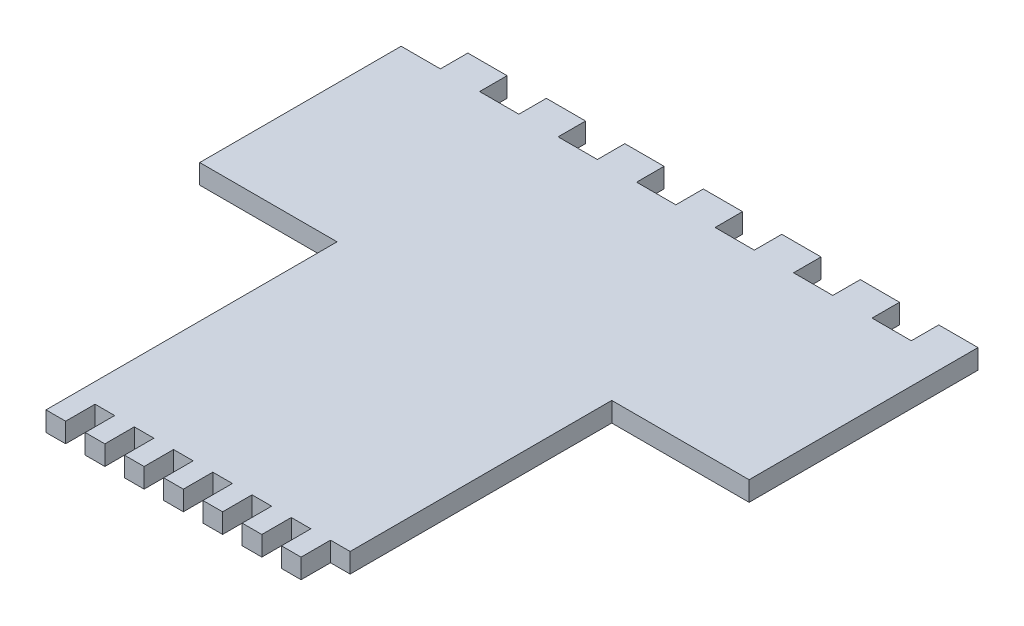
ISO-10303-21;
HEADER;
FILE_DESCRIPTION(('STEP AP214'),'2;1');
FILE_NAME('part.step','',(''),(''),'','','');
FILE_SCHEMA(('AUTOMOTIVE_DESIGN { 1 0 10303 214 1 1 1 1 }'));
ENDSEC;
DATA;
#1=APPLICATION_CONTEXT('core data for automotive mechanical design processes');
#2=APPLICATION_PROTOCOL_DEFINITION('international standard','automotive_design',2000,#1);
#3=PRODUCT_CONTEXT('',#1,'mechanical');
#4=PRODUCT('Part','Part','',(#3));
#5=PRODUCT_RELATED_PRODUCT_CATEGORY('part','',(#4));
#6=PRODUCT_DEFINITION_FORMATION('','',#4);
#7=PRODUCT_DEFINITION_CONTEXT('part definition',#1,'design');
#8=PRODUCT_DEFINITION('design','',#6,#7);
#9=PRODUCT_DEFINITION_SHAPE('','',#8);
#10=(LENGTH_UNIT() NAMED_UNIT(*) SI_UNIT(.MILLI.,.METRE.));
#11=(NAMED_UNIT(*) PLANE_ANGLE_UNIT() SI_UNIT($,.RADIAN.));
#12=(NAMED_UNIT(*) SI_UNIT($,.STERADIAN.) SOLID_ANGLE_UNIT());
#13=UNCERTAINTY_MEASURE_WITH_UNIT(LENGTH_MEASURE(1.E-05),#10,'distance_accuracy_value','');
#14=(GEOMETRIC_REPRESENTATION_CONTEXT(3) GLOBAL_UNCERTAINTY_ASSIGNED_CONTEXT((#13)) GLOBAL_UNIT_ASSIGNED_CONTEXT((#10,
#11,#12)) REPRESENTATION_CONTEXT('',''));
#15=CARTESIAN_POINT('',(0.,0.,0.));
#16=DIRECTION('',(0.,0.,1.));
#17=DIRECTION('',(1.,0.,0.));
#18=AXIS2_PLACEMENT_3D('',#15,#16,#17);
#19=CARTESIAN_POINT('',(-193.139013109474,-12.7,158.75));
#20=DIRECTION('',(0.,1.,0.));
#21=DIRECTION('',(0.,0.,1.));
#22=AXIS2_PLACEMENT_3D('',#19,#20,#21);
#23=PLANE('',#22);
#24=DIRECTION('',(0.,0.,-1.));
#25=VECTOR('',#24,1.);
#26=CARTESIAN_POINT('',(304.799999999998,-12.7,158.750000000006));
#27=LINE('',#26,#25);
#28=CARTESIAN_POINT('',(304.8,-12.7,17.78));
#29=VERTEX_POINT('',#28);
#30=CARTESIAN_POINT('',(304.8,-12.7,0.));
#31=VERTEX_POINT('',#30);
#32=EDGE_CURVE('E438',#29,#31,#27,.T.);
#33=ORIENTED_EDGE('',*,*,#32,.F.);
#34=DIRECTION('',(1.,0.,0.));
#35=VECTOR('',#34,1.);
#36=CARTESIAN_POINT('',(-193.139013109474,-12.7,17.78));
#37=LINE('',#36,#35);
#38=CARTESIAN_POINT('',(330.2,-12.7,17.78));
#39=VERTEX_POINT('',#38);
#40=EDGE_CURVE('E440',#29,#39,#37,.T.);
#41=ORIENTED_EDGE('',*,*,#40,.T.);
#42=DIRECTION('',(0.,0.,-1.));
#43=VECTOR('',#42,1.);
#44=CARTESIAN_POINT('',(330.199999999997,-12.7,158.750000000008));
#45=LINE('',#44,#43);
#46=CARTESIAN_POINT('',(330.2,-12.7,0.));
#47=VERTEX_POINT('',#46);
#48=EDGE_CURVE('E415',#39,#47,#45,.T.);
#49=ORIENTED_EDGE('',*,*,#48,.T.);
#50=DIRECTION('',(1.,0.,0.));
#51=VECTOR('',#50,1.);
#52=CARTESIAN_POINT('',(-193.139013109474,-12.7,0.));
#53=LINE('',#52,#51);
#54=CARTESIAN_POINT('',(355.6,-12.7,0.));
#55=VERTEX_POINT('',#54);
#56=EDGE_CURVE('E790',#47,#55,#53,.T.);
#57=ORIENTED_EDGE('',*,*,#56,.T.);
#58=DIRECTION('',(0.,0.,1.));
#59=VECTOR('',#58,1.);
#60=CARTESIAN_POINT('',(355.6,-12.7,158.75));
#61=LINE('',#60,#59);
#62=CARTESIAN_POINT('',(355.6,-12.7,148.1582));
#63=VERTEX_POINT('',#62);
#64=EDGE_CURVE('E850',#55,#63,#61,.T.);
#65=ORIENTED_EDGE('',*,*,#64,.T.);
#66=DIRECTION('',(1.,0.,0.));
#67=VECTOR('',#66,1.);
#68=CARTESIAN_POINT('',(-193.139013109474,-12.7,148.1582));
#69=LINE('',#68,#67);
#70=CARTESIAN_POINT('',(266.7,-12.7,148.1582));
#71=VERTEX_POINT('',#70);
#72=EDGE_CURVE('E852',#71,#63,#69,.T.);
#73=ORIENTED_EDGE('',*,*,#72,.F.);
#74=DIRECTION('',(0.,0.,1.));
#75=VECTOR('',#74,1.);
#76=CARTESIAN_POINT('',(266.7,-12.7,158.75));
#77=LINE('',#76,#75);
#78=CARTESIAN_POINT('',(266.7,-12.7,317.5));
#79=VERTEX_POINT('',#78);
#80=EDGE_CURVE('E855',#71,#79,#77,.T.);
#81=ORIENTED_EDGE('',*,*,#80,.T.);
#82=DIRECTION('',(1.,0.,0.));
#83=VECTOR('',#82,1.);
#84=CARTESIAN_POINT('',(-193.139013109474,-12.7,317.5));
#85=LINE('',#84,#83);
#86=CARTESIAN_POINT('',(254.,-12.7,317.5));
#87=VERTEX_POINT('',#86);
#88=EDGE_CURVE('E842',#87,#79,#85,.T.);
#89=ORIENTED_EDGE('',*,*,#88,.F.);
#90=DIRECTION('',(0.,0.,-1.));
#91=VECTOR('',#90,1.);
#92=CARTESIAN_POINT('',(254.,-12.7,336.55));
#93=LINE('',#92,#91);
#94=CARTESIAN_POINT('',(254.,-12.7,336.55));
#95=VERTEX_POINT('',#94);
#96=EDGE_CURVE('E593',#95,#87,#93,.T.);
#97=ORIENTED_EDGE('',*,*,#96,.F.);
#98=DIRECTION('',(1.,0.,0.));
#99=VECTOR('',#98,1.);
#100=CARTESIAN_POINT('',(177.791445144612,-12.7,336.55));
#101=LINE('',#100,#99);
#102=CARTESIAN_POINT('',(241.3,-12.7,336.55));
#103=VERTEX_POINT('',#102);
#104=EDGE_CURVE('E591',#103,#95,#101,.T.);
#105=ORIENTED_EDGE('',*,*,#104,.F.);
#106=DIRECTION('',(0.,0.,-1.));
#107=VECTOR('',#106,1.);
#108=CARTESIAN_POINT('',(241.3,-12.7,336.55));
#109=LINE('',#108,#107);
#110=CARTESIAN_POINT('',(241.3,-12.7,317.5));
#111=VERTEX_POINT('',#110);
#112=EDGE_CURVE('E599',#103,#111,#109,.T.);
#113=ORIENTED_EDGE('',*,*,#112,.T.);
#114=CARTESIAN_POINT('',(228.6,-12.7,317.5));
#115=VERTEX_POINT('',#114);
#116=EDGE_CURVE('E838',#115,#111,#85,.T.);
#117=ORIENTED_EDGE('',*,*,#116,.F.);
#118=DIRECTION('',(0.,0.,-1.));
#119=VECTOR('',#118,1.);
#120=CARTESIAN_POINT('',(228.6,-12.7,354.510512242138));
#121=LINE('',#120,#119);
#122=CARTESIAN_POINT('',(228.6,-12.7,336.55));
#123=VERTEX_POINT('',#122);
#124=EDGE_CURVE('E560',#123,#115,#121,.T.);
#125=ORIENTED_EDGE('',*,*,#124,.F.);
#126=DIRECTION('',(1.,0.,0.));
#127=VECTOR('',#126,1.);
#128=CARTESIAN_POINT('',(215.9,-12.7,336.55));
#129=LINE('',#128,#127);
#130=CARTESIAN_POINT('',(215.9,-12.7,336.55));
#131=VERTEX_POINT('',#130);
#132=EDGE_CURVE('E569',#131,#123,#129,.T.);
#133=ORIENTED_EDGE('',*,*,#132,.F.);
#134=DIRECTION('',(0.,0.,-1.));
#135=VECTOR('',#134,1.);
#136=CARTESIAN_POINT('',(215.9,-12.7,354.510512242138));
#137=LINE('',#136,#135);
#138=CARTESIAN_POINT('',(215.9,-12.7,317.5));
#139=VERTEX_POINT('',#138);
#140=EDGE_CURVE('E564',#131,#139,#137,.T.);
#141=ORIENTED_EDGE('',*,*,#140,.T.);
#142=CARTESIAN_POINT('',(203.2,-12.7,317.5));
#143=VERTEX_POINT('',#142);
#144=EDGE_CURVE('E921',#143,#139,#85,.T.);
#145=ORIENTED_EDGE('',*,*,#144,.F.);
#146=DIRECTION('',(0.,0.,-1.));
#147=VECTOR('',#146,1.);
#148=CARTESIAN_POINT('',(203.2,-12.7,336.55));
#149=LINE('',#148,#147);
#150=CARTESIAN_POINT('',(203.2,-12.7,336.55));
#151=VERTEX_POINT('',#150);
#152=EDGE_CURVE('E619',#151,#143,#149,.T.);
#153=ORIENTED_EDGE('',*,*,#152,.F.);
#154=DIRECTION('',(1.,0.,0.));
#155=VECTOR('',#154,1.);
#156=CARTESIAN_POINT('',(177.791445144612,-12.7,336.55));
#157=LINE('',#156,#155);
#158=CARTESIAN_POINT('',(190.5,-12.7,336.55));
#159=VERTEX_POINT('',#158);
#160=EDGE_CURVE('E617',#159,#151,#157,.T.);
#161=ORIENTED_EDGE('',*,*,#160,.F.);
#162=DIRECTION('',(0.,0.,-1.));
#163=VECTOR('',#162,1.);
#164=CARTESIAN_POINT('',(190.5,-12.7,336.55));
#165=LINE('',#164,#163);
#166=CARTESIAN_POINT('',(190.5,-12.7,317.5));
#167=VERTEX_POINT('',#166);
#168=EDGE_CURVE('E624',#159,#167,#165,.T.);
#169=ORIENTED_EDGE('',*,*,#168,.T.);
#170=CARTESIAN_POINT('',(177.8,-12.7,317.5));
#171=VERTEX_POINT('',#170);
#172=EDGE_CURVE('E1564',#171,#167,#85,.T.);
#173=ORIENTED_EDGE('',*,*,#172,.F.);
#174=DIRECTION('',(0.,0.,-1.));
#175=VECTOR('',#174,1.);
#176=CARTESIAN_POINT('',(177.8,-12.7,336.55));
#177=LINE('',#176,#175);
#178=CARTESIAN_POINT('',(177.8,-12.7,336.55));
#179=VERTEX_POINT('',#178);
#180=EDGE_CURVE('E643',#179,#171,#177,.T.);
#181=ORIENTED_EDGE('',*,*,#180,.F.);
#182=DIRECTION('',(1.,0.,0.));
#183=VECTOR('',#182,1.);
#184=CARTESIAN_POINT('',(177.791445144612,-12.7,336.55));
#185=LINE('',#184,#183);
#186=CARTESIAN_POINT('',(165.1,-12.7,336.55));
#187=VERTEX_POINT('',#186);
#188=EDGE_CURVE('E641',#187,#179,#185,.T.);
#189=ORIENTED_EDGE('',*,*,#188,.F.);
#190=DIRECTION('',(0.,0.,-1.));
#191=VECTOR('',#190,1.);
#192=CARTESIAN_POINT('',(165.1,-12.7,336.55));
#193=LINE('',#192,#191);
#194=CARTESIAN_POINT('',(165.1,-12.7,317.5));
#195=VERTEX_POINT('',#194);
#196=EDGE_CURVE('E648',#187,#195,#193,.T.);
#197=ORIENTED_EDGE('',*,*,#196,.T.);
#198=CARTESIAN_POINT('',(152.4,-12.7,317.5));
#199=VERTEX_POINT('',#198);
#200=EDGE_CURVE('E1566',#199,#195,#85,.T.);
#201=ORIENTED_EDGE('',*,*,#200,.F.);
#202=DIRECTION('',(0.,0.,-1.));
#203=VECTOR('',#202,1.);
#204=CARTESIAN_POINT('',(152.4,-12.7,336.55));
#205=LINE('',#204,#203);
#206=CARTESIAN_POINT('',(152.4,-12.7,336.55));
#207=VERTEX_POINT('',#206);
#208=EDGE_CURVE('E667',#207,#199,#205,.T.);
#209=ORIENTED_EDGE('',*,*,#208,.F.);
#210=DIRECTION('',(1.,0.,0.));
#211=VECTOR('',#210,1.);
#212=CARTESIAN_POINT('',(177.791445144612,-12.7,336.55));
#213=LINE('',#212,#211);
#214=CARTESIAN_POINT('',(139.7,-12.7,336.55));
#215=VERTEX_POINT('',#214);
#216=EDGE_CURVE('E665',#215,#207,#213,.T.);
#217=ORIENTED_EDGE('',*,*,#216,.F.);
#218=DIRECTION('',(0.,0.,-1.));
#219=VECTOR('',#218,1.);
#220=CARTESIAN_POINT('',(139.7,-12.7,336.55));
#221=LINE('',#220,#219);
#222=CARTESIAN_POINT('',(139.7,-12.7,317.5));
#223=VERTEX_POINT('',#222);
#224=EDGE_CURVE('E672',#215,#223,#221,.T.);
#225=ORIENTED_EDGE('',*,*,#224,.T.);
#226=CARTESIAN_POINT('',(127.,-12.7,317.5));
#227=VERTEX_POINT('',#226);
#228=EDGE_CURVE('E837',#227,#223,#85,.T.);
#229=ORIENTED_EDGE('',*,*,#228,.F.);
#230=DIRECTION('',(0.,0.,-1.));
#231=VECTOR('',#230,1.);
#232=CARTESIAN_POINT('',(127.,-12.7,336.55));
#233=LINE('',#232,#231);
#234=CARTESIAN_POINT('',(127.,-12.7,336.55));
#235=VERTEX_POINT('',#234);
#236=EDGE_CURVE('E691',#235,#227,#233,.T.);
#237=ORIENTED_EDGE('',*,*,#236,.F.);
#238=DIRECTION('',(1.,0.,0.));
#239=VECTOR('',#238,1.);
#240=CARTESIAN_POINT('',(177.791445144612,-12.7,336.55));
#241=LINE('',#240,#239);
#242=CARTESIAN_POINT('',(114.3,-12.7,336.55));
#243=VERTEX_POINT('',#242);
#244=EDGE_CURVE('E689',#243,#235,#241,.T.);
#245=ORIENTED_EDGE('',*,*,#244,.F.);
#246=DIRECTION('',(0.,0.,-1.));
#247=VECTOR('',#246,1.);
#248=CARTESIAN_POINT('',(114.3,-12.7,336.55));
#249=LINE('',#248,#247);
#250=CARTESIAN_POINT('',(114.3,-12.7,317.5));
#251=VERTEX_POINT('',#250);
#252=EDGE_CURVE('E696',#243,#251,#249,.T.);
#253=ORIENTED_EDGE('',*,*,#252,.T.);
#254=CARTESIAN_POINT('',(88.9,-12.7,317.5));
#255=VERTEX_POINT('',#254);
#256=EDGE_CURVE('E833',#255,#251,#85,.T.);
#257=ORIENTED_EDGE('',*,*,#256,.F.);
#258=DIRECTION('',(0.,0.,1.));
#259=VECTOR('',#258,1.);
#260=CARTESIAN_POINT('',(88.9,-12.7,158.75));
#261=LINE('',#260,#259);
#262=CARTESIAN_POINT('',(88.8999999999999,-12.7,148.1582));
#263=VERTEX_POINT('',#262);
#264=EDGE_CURVE('E839',#263,#255,#261,.T.);
#265=ORIENTED_EDGE('',*,*,#264,.F.);
#266=CARTESIAN_POINT('',(0.,-12.7,148.1582));
#267=VERTEX_POINT('',#266);
#268=EDGE_CURVE('E843',#267,#263,#69,.T.);
#269=ORIENTED_EDGE('',*,*,#268,.F.);
#270=DIRECTION('',(0.,0.,1.));
#271=VECTOR('',#270,1.);
#272=CARTESIAN_POINT('',(0.,-12.7,158.75));
#273=LINE('',#272,#271);
#274=CARTESIAN_POINT('',(0.,-12.7,17.78));
#275=VERTEX_POINT('',#274);
#276=EDGE_CURVE('E844',#275,#267,#273,.T.);
#277=ORIENTED_EDGE('',*,*,#276,.F.);
#278=DIRECTION('',(1.,0.,0.));
#279=VECTOR('',#278,1.);
#280=CARTESIAN_POINT('',(-193.139013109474,-12.7,17.78));
#281=LINE('',#280,#279);
#282=CARTESIAN_POINT('',(25.4,-12.7,17.78));
#283=VERTEX_POINT('',#282);
#284=EDGE_CURVE('E553',#275,#283,#281,.T.);
#285=ORIENTED_EDGE('',*,*,#284,.T.);
#286=DIRECTION('',(0.,0.,-1.));
#287=VECTOR('',#286,1.);
#288=CARTESIAN_POINT('',(25.3999999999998,-12.7,158.75));
#289=LINE('',#288,#287);
#290=CARTESIAN_POINT('',(25.4,-12.7,0.));
#291=VERTEX_POINT('',#290);
#292=EDGE_CURVE('E549',#283,#291,#289,.T.);
#293=ORIENTED_EDGE('',*,*,#292,.T.);
#294=CARTESIAN_POINT('',(50.8,-12.7,0.));
#295=VERTEX_POINT('',#294);
#296=EDGE_CURVE('E846',#291,#295,#53,.T.);
#297=ORIENTED_EDGE('',*,*,#296,.T.);
#298=DIRECTION('',(0.,0.,-1.));
#299=VECTOR('',#298,1.);
#300=CARTESIAN_POINT('',(50.7999999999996,-12.7,158.750000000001));
#301=LINE('',#300,#299);
#302=CARTESIAN_POINT('',(50.8,-12.7,17.78));
#303=VERTEX_POINT('',#302);
#304=EDGE_CURVE('E536',#303,#295,#301,.T.);
#305=ORIENTED_EDGE('',*,*,#304,.F.);
#306=DIRECTION('',(1.,0.,0.));
#307=VECTOR('',#306,1.);
#308=CARTESIAN_POINT('',(-193.139013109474,-12.7,17.78));
#309=LINE('',#308,#307);
#310=CARTESIAN_POINT('',(76.1999999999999,-12.7,17.78));
#311=VERTEX_POINT('',#310);
#312=EDGE_CURVE('E538',#303,#311,#309,.T.);
#313=ORIENTED_EDGE('',*,*,#312,.T.);
#314=DIRECTION('',(0.,0.,-1.));
#315=VECTOR('',#314,1.);
#316=CARTESIAN_POINT('',(76.1999999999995,-12.7,158.750000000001));
#317=LINE('',#316,#315);
#318=CARTESIAN_POINT('',(76.1999999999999,-12.7,0.));
#319=VERTEX_POINT('',#318);
#320=EDGE_CURVE('E532',#311,#319,#317,.T.);
#321=ORIENTED_EDGE('',*,*,#320,.T.);
#322=CARTESIAN_POINT('',(101.6,-12.7,0.));
#323=VERTEX_POINT('',#322);
#324=EDGE_CURVE('E849',#319,#323,#53,.T.);
#325=ORIENTED_EDGE('',*,*,#324,.T.);
#326=DIRECTION('',(0.,0.,-1.));
#327=VECTOR('',#326,1.);
#328=CARTESIAN_POINT('',(101.599999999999,-12.7,158.750000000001));
#329=LINE('',#328,#327);
#330=CARTESIAN_POINT('',(101.6,-12.7,17.78));
#331=VERTEX_POINT('',#330);
#332=EDGE_CURVE('E516',#331,#323,#329,.T.);
#333=ORIENTED_EDGE('',*,*,#332,.F.);
#334=DIRECTION('',(1.,0.,0.));
#335=VECTOR('',#334,1.);
#336=CARTESIAN_POINT('',(-193.139013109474,-12.7,17.78));
#337=LINE('',#336,#335);
#338=CARTESIAN_POINT('',(127.,-12.7,17.78));
#339=VERTEX_POINT('',#338);
#340=EDGE_CURVE('E518',#331,#339,#337,.T.);
#341=ORIENTED_EDGE('',*,*,#340,.T.);
#342=DIRECTION('',(0.,0.,-1.));
#343=VECTOR('',#342,1.);
#344=CARTESIAN_POINT('',(126.999999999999,-12.7,158.750000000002));
#345=LINE('',#344,#343);
#346=CARTESIAN_POINT('',(127.,-12.7,0.));
#347=VERTEX_POINT('',#346);
#348=EDGE_CURVE('E512',#339,#347,#345,.T.);
#349=ORIENTED_EDGE('',*,*,#348,.T.);
#350=CARTESIAN_POINT('',(152.4,-12.7,0.));
#351=VERTEX_POINT('',#350);
#352=EDGE_CURVE('E1594',#347,#351,#53,.T.);
#353=ORIENTED_EDGE('',*,*,#352,.T.);
#354=DIRECTION('',(0.,0.,-1.));
#355=VECTOR('',#354,1.);
#356=CARTESIAN_POINT('',(152.399999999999,-12.7,158.750000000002));
#357=LINE('',#356,#355);
#358=CARTESIAN_POINT('',(152.4,-12.7,17.78));
#359=VERTEX_POINT('',#358);
#360=EDGE_CURVE('E496',#359,#351,#357,.T.);
#361=ORIENTED_EDGE('',*,*,#360,.F.);
#362=DIRECTION('',(1.,0.,0.));
#363=VECTOR('',#362,1.);
#364=CARTESIAN_POINT('',(-193.139013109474,-12.7,17.78));
#365=LINE('',#364,#363);
#366=CARTESIAN_POINT('',(177.8,-12.7,17.78));
#367=VERTEX_POINT('',#366);
#368=EDGE_CURVE('E498',#359,#367,#365,.T.);
#369=ORIENTED_EDGE('',*,*,#368,.T.);
#370=DIRECTION('',(0.,0.,-1.));
#371=VECTOR('',#370,1.);
#372=CARTESIAN_POINT('',(177.799999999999,-12.7,158.750000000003));
#373=LINE('',#372,#371);
#374=CARTESIAN_POINT('',(177.8,-12.7,0.));
#375=VERTEX_POINT('',#374);
#376=EDGE_CURVE('E492',#367,#375,#373,.T.);
#377=ORIENTED_EDGE('',*,*,#376,.T.);
#378=CARTESIAN_POINT('',(203.2,-12.7,0.));
#379=VERTEX_POINT('',#378);
#380=EDGE_CURVE('E1596',#375,#379,#53,.T.);
#381=ORIENTED_EDGE('',*,*,#380,.T.);
#382=DIRECTION('',(0.,0.,-1.));
#383=VECTOR('',#382,1.);
#384=CARTESIAN_POINT('',(203.199999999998,-12.7,158.750000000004));
#385=LINE('',#384,#383);
#386=CARTESIAN_POINT('',(203.2,-12.7,17.78));
#387=VERTEX_POINT('',#386);
#388=EDGE_CURVE('E476',#387,#379,#385,.T.);
#389=ORIENTED_EDGE('',*,*,#388,.F.);
#390=DIRECTION('',(1.,0.,0.));
#391=VECTOR('',#390,1.);
#392=CARTESIAN_POINT('',(-193.139013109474,-12.7,17.78));
#393=LINE('',#392,#391);
#394=CARTESIAN_POINT('',(228.6,-12.7,17.78));
#395=VERTEX_POINT('',#394);
#396=EDGE_CURVE('E478',#387,#395,#393,.T.);
#397=ORIENTED_EDGE('',*,*,#396,.T.);
#398=DIRECTION('',(0.,0.,-1.));
#399=VECTOR('',#398,1.);
#400=CARTESIAN_POINT('',(228.599999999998,-12.7,158.750000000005));
#401=LINE('',#400,#399);
#402=CARTESIAN_POINT('',(228.6,-12.7,0.));
#403=VERTEX_POINT('',#402);
#404=EDGE_CURVE('E472',#395,#403,#401,.T.);
#405=ORIENTED_EDGE('',*,*,#404,.T.);
#406=CARTESIAN_POINT('',(254.,-12.7,0.));
#407=VERTEX_POINT('',#406);
#408=EDGE_CURVE('E1600',#403,#407,#53,.T.);
#409=ORIENTED_EDGE('',*,*,#408,.T.);
#410=DIRECTION('',(0.,0.,-1.));
#411=VECTOR('',#410,1.);
#412=CARTESIAN_POINT('',(253.999999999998,-12.7,158.750000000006));
#413=LINE('',#412,#411);
#414=CARTESIAN_POINT('',(254.,-12.7,17.78));
#415=VERTEX_POINT('',#414);
#416=EDGE_CURVE('E456',#415,#407,#413,.T.);
#417=ORIENTED_EDGE('',*,*,#416,.F.);
#418=DIRECTION('',(1.,0.,0.));
#419=VECTOR('',#418,1.);
#420=CARTESIAN_POINT('',(-193.139013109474,-12.7,17.78));
#421=LINE('',#420,#419);
#422=CARTESIAN_POINT('',(279.4,-12.7,17.78));
#423=VERTEX_POINT('',#422);
#424=EDGE_CURVE('E458',#415,#423,#421,.T.);
#425=ORIENTED_EDGE('',*,*,#424,.T.);
#426=DIRECTION('',(0.,0.,-1.));
#427=VECTOR('',#426,1.);
#428=CARTESIAN_POINT('',(279.399999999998,-12.7,158.750000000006));
#429=LINE('',#428,#427);
#430=CARTESIAN_POINT('',(279.4,-12.7,0.));
#431=VERTEX_POINT('',#430);
#432=EDGE_CURVE('E452',#423,#431,#429,.T.);
#433=ORIENTED_EDGE('',*,*,#432,.T.);
#434=EDGE_CURVE('E1604',#431,#31,#53,.T.);
#435=ORIENTED_EDGE('',*,*,#434,.T.);
#436=EDGE_LOOP('',(#33,#41,#49,#57,#65,#73,#81,#89,#97,#105,#113,#117,#125,#133,#141,#145,#153,
#161,#169,#173,#181,#189,#197,#201,#209,#217,#225,#229,#237,#245,#253,#257,#265,#269,#277,#285,
#293,#297,#305,#313,#321,#325,#333,#341,#349,#353,#361,#369,#377,#381,#389,#397,#405,#409,#417,
#425,#433,#435));
#437=FACE_BOUND('',#436,.T.);
#438=ADVANCED_FACE('F34',(#437),#23,.F.);
#439=CARTESIAN_POINT('',(-193.139013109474,0.,158.75));
#440=DIRECTION('',(0.,1.,0.));
#441=DIRECTION('',(0.,0.,1.));
#442=AXIS2_PLACEMENT_3D('',#439,#440,#441);
#443=PLANE('',#442);
#444=DIRECTION('',(1.,0.,0.));
#445=VECTOR('',#444,1.);
#446=CARTESIAN_POINT('',(-354.540208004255,0.,17.78));
#447=LINE('',#446,#445);
#448=CARTESIAN_POINT('',(304.8,0.,17.78));
#449=VERTEX_POINT('',#448);
#450=CARTESIAN_POINT('',(330.2,0.,17.78));
#451=VERTEX_POINT('',#450);
#452=EDGE_CURVE('E422',#449,#451,#447,.T.);
#453=ORIENTED_EDGE('',*,*,#452,.F.);
#454=DIRECTION('',(0.,0.,-1.));
#455=VECTOR('',#454,1.);
#456=CARTESIAN_POINT('',(304.799999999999,0.,103.38713710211));
#457=LINE('',#456,#455);
#458=CARTESIAN_POINT('',(304.8,0.,0.));
#459=VERTEX_POINT('',#458);
#460=EDGE_CURVE('E419',#449,#459,#457,.T.);
#461=ORIENTED_EDGE('',*,*,#460,.T.);
#462=DIRECTION('',(1.,0.,0.));
#463=VECTOR('',#462,1.);
#464=CARTESIAN_POINT('',(-193.139013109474,0.,0.));
#465=LINE('',#464,#463);
#466=CARTESIAN_POINT('',(279.4,0.,0.));
#467=VERTEX_POINT('',#466);
#468=EDGE_CURVE('E799',#467,#459,#465,.T.);
#469=ORIENTED_EDGE('',*,*,#468,.F.);
#470=DIRECTION('',(0.,0.,-1.));
#471=VECTOR('',#470,1.);
#472=CARTESIAN_POINT('',(279.399999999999,0.,103.387137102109));
#473=LINE('',#472,#471);
#474=CARTESIAN_POINT('',(279.4,0.,17.78));
#475=VERTEX_POINT('',#474);
#476=EDGE_CURVE('E57',#475,#467,#473,.T.);
#477=ORIENTED_EDGE('',*,*,#476,.F.);
#478=DIRECTION('',(1.,0.,0.));
#479=VECTOR('',#478,1.);
#480=CARTESIAN_POINT('',(-354.540208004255,0.,17.78));
#481=LINE('',#480,#479);
#482=CARTESIAN_POINT('',(254.,0.,17.78));
#483=VERTEX_POINT('',#482);
#484=EDGE_CURVE('E442',#483,#475,#481,.T.);
#485=ORIENTED_EDGE('',*,*,#484,.F.);
#486=DIRECTION('',(0.,0.,-1.));
#487=VECTOR('',#486,1.);
#488=CARTESIAN_POINT('',(253.999999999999,0.,103.387137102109));
#489=LINE('',#488,#487);
#490=CARTESIAN_POINT('',(254.,0.,0.));
#491=VERTEX_POINT('',#490);
#492=EDGE_CURVE('E446',#483,#491,#489,.T.);
#493=ORIENTED_EDGE('',*,*,#492,.T.);
#494=CARTESIAN_POINT('',(228.6,0.,0.));
#495=VERTEX_POINT('',#494);
#496=EDGE_CURVE('E803',#495,#491,#465,.T.);
#497=ORIENTED_EDGE('',*,*,#496,.F.);
#498=DIRECTION('',(0.,0.,-1.));
#499=VECTOR('',#498,1.);
#500=CARTESIAN_POINT('',(228.599999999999,0.,103.387137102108));
#501=LINE('',#500,#499);
#502=CARTESIAN_POINT('',(228.6,0.,17.78));
#503=VERTEX_POINT('',#502);
#504=EDGE_CURVE('E464',#503,#495,#501,.T.);
#505=ORIENTED_EDGE('',*,*,#504,.F.);
#506=DIRECTION('',(1.,0.,0.));
#507=VECTOR('',#506,1.);
#508=CARTESIAN_POINT('',(-354.540208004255,0.,17.78));
#509=LINE('',#508,#507);
#510=CARTESIAN_POINT('',(203.2,0.,17.78));
#511=VERTEX_POINT('',#510);
#512=EDGE_CURVE('E461',#511,#503,#509,.T.);
#513=ORIENTED_EDGE('',*,*,#512,.F.);
#514=DIRECTION('',(0.,0.,-1.));
#515=VECTOR('',#514,1.);
#516=CARTESIAN_POINT('',(203.199999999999,0.,103.387137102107));
#517=LINE('',#516,#515);
#518=CARTESIAN_POINT('',(203.2,0.,0.));
#519=VERTEX_POINT('',#518);
#520=EDGE_CURVE('E466',#511,#519,#517,.T.);
#521=ORIENTED_EDGE('',*,*,#520,.T.);
#522=CARTESIAN_POINT('',(177.8,0.,0.));
#523=VERTEX_POINT('',#522);
#524=EDGE_CURVE('E806',#523,#519,#465,.T.);
#525=ORIENTED_EDGE('',*,*,#524,.F.);
#526=DIRECTION('',(0.,0.,-1.));
#527=VECTOR('',#526,1.);
#528=CARTESIAN_POINT('',(177.799999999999,0.,103.387137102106));
#529=LINE('',#528,#527);
#530=CARTESIAN_POINT('',(177.8,0.,17.78));
#531=VERTEX_POINT('',#530);
#532=EDGE_CURVE('E484',#531,#523,#529,.T.);
#533=ORIENTED_EDGE('',*,*,#532,.F.);
#534=DIRECTION('',(1.,0.,0.));
#535=VECTOR('',#534,1.);
#536=CARTESIAN_POINT('',(-354.540208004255,0.,17.78));
#537=LINE('',#536,#535);
#538=CARTESIAN_POINT('',(152.4,0.,17.78));
#539=VERTEX_POINT('',#538);
#540=EDGE_CURVE('E481',#539,#531,#537,.T.);
#541=ORIENTED_EDGE('',*,*,#540,.F.);
#542=DIRECTION('',(0.,0.,-1.));
#543=VECTOR('',#542,1.);
#544=CARTESIAN_POINT('',(152.399999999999,0.,103.387137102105));
#545=LINE('',#544,#543);
#546=CARTESIAN_POINT('',(152.4,0.,0.));
#547=VERTEX_POINT('',#546);
#548=EDGE_CURVE('E486',#539,#547,#545,.T.);
#549=ORIENTED_EDGE('',*,*,#548,.T.);
#550=CARTESIAN_POINT('',(127.,0.,0.));
#551=VERTEX_POINT('',#550);
#552=EDGE_CURVE('E1622',#551,#547,#465,.T.);
#553=ORIENTED_EDGE('',*,*,#552,.F.);
#554=DIRECTION('',(0.,0.,-1.));
#555=VECTOR('',#554,1.);
#556=CARTESIAN_POINT('',(126.999999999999,0.,103.387137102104));
#557=LINE('',#556,#555);
#558=CARTESIAN_POINT('',(127.,0.,17.78));
#559=VERTEX_POINT('',#558);
#560=EDGE_CURVE('E504',#559,#551,#557,.T.);
#561=ORIENTED_EDGE('',*,*,#560,.F.);
#562=DIRECTION('',(1.,0.,0.));
#563=VECTOR('',#562,1.);
#564=CARTESIAN_POINT('',(-354.540208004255,0.,17.78));
#565=LINE('',#564,#563);
#566=CARTESIAN_POINT('',(101.6,0.,17.78));
#567=VERTEX_POINT('',#566);
#568=EDGE_CURVE('E501',#567,#559,#565,.T.);
#569=ORIENTED_EDGE('',*,*,#568,.F.);
#570=DIRECTION('',(0.,0.,-1.));
#571=VECTOR('',#570,1.);
#572=CARTESIAN_POINT('',(101.6,0.,103.387137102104));
#573=LINE('',#572,#571);
#574=CARTESIAN_POINT('',(101.6,0.,0.));
#575=VERTEX_POINT('',#574);
#576=EDGE_CURVE('E506',#567,#575,#573,.T.);
#577=ORIENTED_EDGE('',*,*,#576,.T.);
#578=CARTESIAN_POINT('',(76.2,0.,0.));
#579=VERTEX_POINT('',#578);
#580=EDGE_CURVE('E812',#579,#575,#465,.T.);
#581=ORIENTED_EDGE('',*,*,#580,.F.);
#582=DIRECTION('',(0.,0.,-1.));
#583=VECTOR('',#582,1.);
#584=CARTESIAN_POINT('',(76.1999999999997,0.,103.387137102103));
#585=LINE('',#584,#583);
#586=CARTESIAN_POINT('',(76.1999999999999,0.,17.78));
#587=VERTEX_POINT('',#586);
#588=EDGE_CURVE('E524',#587,#579,#585,.T.);
#589=ORIENTED_EDGE('',*,*,#588,.F.);
#590=DIRECTION('',(1.,0.,0.));
#591=VECTOR('',#590,1.);
#592=CARTESIAN_POINT('',(-354.540208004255,0.,17.78));
#593=LINE('',#592,#591);
#594=CARTESIAN_POINT('',(50.8,0.,17.78));
#595=VERTEX_POINT('',#594);
#596=EDGE_CURVE('E521',#595,#587,#593,.T.);
#597=ORIENTED_EDGE('',*,*,#596,.F.);
#598=DIRECTION('',(0.,0.,-1.));
#599=VECTOR('',#598,1.);
#600=CARTESIAN_POINT('',(50.7999999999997,0.,103.387137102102));
#601=LINE('',#600,#599);
#602=CARTESIAN_POINT('',(50.8,0.,0.));
#603=VERTEX_POINT('',#602);
#604=EDGE_CURVE('E526',#595,#603,#601,.T.);
#605=ORIENTED_EDGE('',*,*,#604,.T.);
#606=CARTESIAN_POINT('',(25.4,0.,0.));
#607=VERTEX_POINT('',#606);
#608=EDGE_CURVE('E808',#607,#603,#465,.T.);
#609=ORIENTED_EDGE('',*,*,#608,.F.);
#610=DIRECTION('',(0.,0.,-1.));
#611=VECTOR('',#610,1.);
#612=CARTESIAN_POINT('',(25.3999999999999,0.,103.387137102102));
#613=LINE('',#612,#611);
#614=CARTESIAN_POINT('',(25.4,0.,17.78));
#615=VERTEX_POINT('',#614);
#616=EDGE_CURVE('E544',#615,#607,#613,.T.);
#617=ORIENTED_EDGE('',*,*,#616,.F.);
#618=DIRECTION('',(1.,0.,0.));
#619=VECTOR('',#618,1.);
#620=CARTESIAN_POINT('',(-354.540208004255,0.,17.78));
#621=LINE('',#620,#619);
#622=CARTESIAN_POINT('',(0.,0.,17.78));
#623=VERTEX_POINT('',#622);
#624=EDGE_CURVE('E541',#623,#615,#621,.T.);
#625=ORIENTED_EDGE('',*,*,#624,.F.);
#626=DIRECTION('',(0.,0.,1.));
#627=VECTOR('',#626,1.);
#628=CARTESIAN_POINT('',(0.,0.,158.75));
#629=LINE('',#628,#627);
#630=CARTESIAN_POINT('',(0.,0.,148.1582));
#631=VERTEX_POINT('',#630);
#632=EDGE_CURVE('E811',#623,#631,#629,.T.);
#633=ORIENTED_EDGE('',*,*,#632,.T.);
#634=DIRECTION('',(1.,0.,0.));
#635=VECTOR('',#634,1.);
#636=CARTESIAN_POINT('',(-193.139013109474,0.,148.1582));
#637=LINE('',#636,#635);
#638=CARTESIAN_POINT('',(88.8999999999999,0.,148.1582));
#639=VERTEX_POINT('',#638);
#640=EDGE_CURVE('E814',#631,#639,#637,.T.);
#641=ORIENTED_EDGE('',*,*,#640,.T.);
#642=DIRECTION('',(0.,0.,1.));
#643=VECTOR('',#642,1.);
#644=CARTESIAN_POINT('',(88.9,0.,158.75));
#645=LINE('',#644,#643);
#646=CARTESIAN_POINT('',(88.9,0.,336.55));
#647=VERTEX_POINT('',#646);
#648=EDGE_CURVE('E739',#639,#647,#645,.T.);
#649=ORIENTED_EDGE('',*,*,#648,.T.);
#650=DIRECTION('',(-1.,0.,0.));
#651=VECTOR('',#650,1.);
#652=CARTESIAN_POINT('',(177.791445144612,0.,336.55));
#653=LINE('',#652,#651);
#654=CARTESIAN_POINT('',(101.6,0.,336.55));
#655=VERTEX_POINT('',#654);
#656=EDGE_CURVE('E714',#655,#647,#653,.T.);
#657=ORIENTED_EDGE('',*,*,#656,.F.);
#658=DIRECTION('',(0.,0.,-1.));
#659=VECTOR('',#658,1.);
#660=CARTESIAN_POINT('',(101.6,0.,336.55));
#661=LINE('',#660,#659);
#662=CARTESIAN_POINT('',(101.6,0.,317.5));
#663=VERTEX_POINT('',#662);
#664=EDGE_CURVE('E717',#655,#663,#661,.T.);
#665=ORIENTED_EDGE('',*,*,#664,.T.);
#666=DIRECTION('',(1.,0.,0.));
#667=VECTOR('',#666,1.);
#668=CARTESIAN_POINT('',(-193.139013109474,0.,317.5));
#669=LINE('',#668,#667);
#670=CARTESIAN_POINT('',(114.3,0.,317.5));
#671=VERTEX_POINT('',#670);
#672=EDGE_CURVE('E733',#663,#671,#669,.T.);
#673=ORIENTED_EDGE('',*,*,#672,.T.);
#674=DIRECTION('',(0.,0.,-1.));
#675=VECTOR('',#674,1.);
#676=CARTESIAN_POINT('',(114.3,0.,336.55));
#677=LINE('',#676,#675);
#678=CARTESIAN_POINT('',(114.3,0.,336.55));
#679=VERTEX_POINT('',#678);
#680=EDGE_CURVE('E699',#679,#671,#677,.T.);
#681=ORIENTED_EDGE('',*,*,#680,.F.);
#682=DIRECTION('',(-1.,0.,0.));
#683=VECTOR('',#682,1.);
#684=CARTESIAN_POINT('',(177.791445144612,0.,336.55));
#685=LINE('',#684,#683);
#686=CARTESIAN_POINT('',(127.,0.,336.55));
#687=VERTEX_POINT('',#686);
#688=EDGE_CURVE('E684',#687,#679,#685,.T.);
#689=ORIENTED_EDGE('',*,*,#688,.F.);
#690=DIRECTION('',(0.,0.,-1.));
#691=VECTOR('',#690,1.);
#692=CARTESIAN_POINT('',(127.,0.,336.55));
#693=LINE('',#692,#691);
#694=CARTESIAN_POINT('',(127.,0.,317.5));
#695=VERTEX_POINT('',#694);
#696=EDGE_CURVE('E701',#687,#695,#693,.T.);
#697=ORIENTED_EDGE('',*,*,#696,.T.);
#698=CARTESIAN_POINT('',(139.7,0.,317.5));
#699=VERTEX_POINT('',#698);
#700=EDGE_CURVE('E729',#695,#699,#669,.T.);
#701=ORIENTED_EDGE('',*,*,#700,.T.);
#702=DIRECTION('',(0.,0.,-1.));
#703=VECTOR('',#702,1.);
#704=CARTESIAN_POINT('',(139.7,0.,336.55));
#705=LINE('',#704,#703);
#706=CARTESIAN_POINT('',(139.7,0.,336.55));
#707=VERTEX_POINT('',#706);
#708=EDGE_CURVE('E675',#707,#699,#705,.T.);
#709=ORIENTED_EDGE('',*,*,#708,.F.);
#710=DIRECTION('',(-1.,0.,0.));
#711=VECTOR('',#710,1.);
#712=CARTESIAN_POINT('',(177.791445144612,0.,336.55));
#713=LINE('',#712,#711);
#714=CARTESIAN_POINT('',(152.4,0.,336.55));
#715=VERTEX_POINT('',#714);
#716=EDGE_CURVE('E660',#715,#707,#713,.T.);
#717=ORIENTED_EDGE('',*,*,#716,.F.);
#718=DIRECTION('',(0.,0.,-1.));
#719=VECTOR('',#718,1.);
#720=CARTESIAN_POINT('',(152.4,0.,336.55));
#721=LINE('',#720,#719);
#722=CARTESIAN_POINT('',(152.4,0.,317.5));
#723=VERTEX_POINT('',#722);
#724=EDGE_CURVE('E677',#715,#723,#721,.T.);
#725=ORIENTED_EDGE('',*,*,#724,.T.);
#726=CARTESIAN_POINT('',(165.1,0.,317.5));
#727=VERTEX_POINT('',#726);
#728=EDGE_CURVE('E734',#723,#727,#669,.T.);
#729=ORIENTED_EDGE('',*,*,#728,.T.);
#730=DIRECTION('',(0.,0.,-1.));
#731=VECTOR('',#730,1.);
#732=CARTESIAN_POINT('',(165.1,0.,336.55));
#733=LINE('',#732,#731);
#734=CARTESIAN_POINT('',(165.1,0.,336.55));
#735=VERTEX_POINT('',#734);
#736=EDGE_CURVE('E651',#735,#727,#733,.T.);
#737=ORIENTED_EDGE('',*,*,#736,.F.);
#738=DIRECTION('',(-1.,0.,0.));
#739=VECTOR('',#738,1.);
#740=CARTESIAN_POINT('',(177.791445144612,0.,336.55));
#741=LINE('',#740,#739);
#742=CARTESIAN_POINT('',(177.8,0.,336.55));
#743=VERTEX_POINT('',#742);
#744=EDGE_CURVE('E636',#743,#735,#741,.T.);
#745=ORIENTED_EDGE('',*,*,#744,.F.);
#746=DIRECTION('',(0.,0.,-1.));
#747=VECTOR('',#746,1.);
#748=CARTESIAN_POINT('',(177.8,0.,336.55));
#749=LINE('',#748,#747);
#750=CARTESIAN_POINT('',(177.8,0.,317.5));
#751=VERTEX_POINT('',#750);
#752=EDGE_CURVE('E653',#743,#751,#749,.T.);
#753=ORIENTED_EDGE('',*,*,#752,.T.);
#754=CARTESIAN_POINT('',(190.5,0.,317.5));
#755=VERTEX_POINT('',#754);
#756=EDGE_CURVE('E752',#751,#755,#669,.T.);
#757=ORIENTED_EDGE('',*,*,#756,.T.);
#758=DIRECTION('',(0.,0.,-1.));
#759=VECTOR('',#758,1.);
#760=CARTESIAN_POINT('',(190.5,0.,336.55));
#761=LINE('',#760,#759);
#762=CARTESIAN_POINT('',(190.5,0.,336.55));
#763=VERTEX_POINT('',#762);
#764=EDGE_CURVE('E627',#763,#755,#761,.T.);
#765=ORIENTED_EDGE('',*,*,#764,.F.);
#766=DIRECTION('',(-1.,0.,0.));
#767=VECTOR('',#766,1.);
#768=CARTESIAN_POINT('',(177.791445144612,0.,336.55));
#769=LINE('',#768,#767);
#770=CARTESIAN_POINT('',(203.2,0.,336.55));
#771=VERTEX_POINT('',#770);
#772=EDGE_CURVE('E612',#771,#763,#769,.T.);
#773=ORIENTED_EDGE('',*,*,#772,.F.);
#774=DIRECTION('',(0.,0.,-1.));
#775=VECTOR('',#774,1.);
#776=CARTESIAN_POINT('',(203.2,0.,336.55));
#777=LINE('',#776,#775);
#778=CARTESIAN_POINT('',(203.2,0.,317.5));
#779=VERTEX_POINT('',#778);
#780=EDGE_CURVE('E629',#771,#779,#777,.T.);
#781=ORIENTED_EDGE('',*,*,#780,.T.);
#782=CARTESIAN_POINT('',(215.9,0.,317.5));
#783=VERTEX_POINT('',#782);
#784=EDGE_CURVE('E754',#779,#783,#669,.T.);
#785=ORIENTED_EDGE('',*,*,#784,.T.);
#786=DIRECTION('',(0.,0.,-1.));
#787=VECTOR('',#786,1.);
#788=CARTESIAN_POINT('',(215.9,0.,354.510512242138));
#789=LINE('',#788,#787);
#790=CARTESIAN_POINT('',(215.9,0.,336.55));
#791=VERTEX_POINT('',#790);
#792=EDGE_CURVE('E556',#791,#783,#789,.T.);
#793=ORIENTED_EDGE('',*,*,#792,.F.);
#794=DIRECTION('',(-1.,0.,0.));
#795=VECTOR('',#794,1.);
#796=CARTESIAN_POINT('',(215.9,0.,336.55));
#797=LINE('',#796,#795);
#798=CARTESIAN_POINT('',(228.6,0.,336.55));
#799=VERTEX_POINT('',#798);
#800=EDGE_CURVE('E575',#799,#791,#797,.T.);
#801=ORIENTED_EDGE('',*,*,#800,.F.);
#802=DIRECTION('',(0.,0.,-1.));
#803=VECTOR('',#802,1.);
#804=CARTESIAN_POINT('',(228.6,0.,354.510512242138));
#805=LINE('',#804,#803);
#806=CARTESIAN_POINT('',(228.6,0.,317.5));
#807=VERTEX_POINT('',#806);
#808=EDGE_CURVE('E559',#799,#807,#805,.T.);
#809=ORIENTED_EDGE('',*,*,#808,.T.);
#810=CARTESIAN_POINT('',(241.3,0.,317.5));
#811=VERTEX_POINT('',#810);
#812=EDGE_CURVE('E757',#807,#811,#669,.T.);
#813=ORIENTED_EDGE('',*,*,#812,.T.);
#814=DIRECTION('',(0.,0.,-1.));
#815=VECTOR('',#814,1.);
#816=CARTESIAN_POINT('',(241.3,0.,336.55));
#817=LINE('',#816,#815);
#818=CARTESIAN_POINT('',(241.3,0.,336.55));
#819=VERTEX_POINT('',#818);
#820=EDGE_CURVE('E602',#819,#811,#817,.T.);
#821=ORIENTED_EDGE('',*,*,#820,.F.);
#822=DIRECTION('',(-1.,0.,0.));
#823=VECTOR('',#822,1.);
#824=CARTESIAN_POINT('',(177.791445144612,0.,336.55));
#825=LINE('',#824,#823);
#826=CARTESIAN_POINT('',(254.,0.,336.55));
#827=VERTEX_POINT('',#826);
#828=EDGE_CURVE('E586',#827,#819,#825,.T.);
#829=ORIENTED_EDGE('',*,*,#828,.F.);
#830=DIRECTION('',(0.,0.,-1.));
#831=VECTOR('',#830,1.);
#832=CARTESIAN_POINT('',(254.,0.,336.55));
#833=LINE('',#832,#831);
#834=CARTESIAN_POINT('',(254.,0.,317.5));
#835=VERTEX_POINT('',#834);
#836=EDGE_CURVE('E605',#827,#835,#833,.T.);
#837=ORIENTED_EDGE('',*,*,#836,.T.);
#838=CARTESIAN_POINT('',(266.7,0.,317.5));
#839=VERTEX_POINT('',#838);
#840=EDGE_CURVE('E756',#835,#839,#669,.T.);
#841=ORIENTED_EDGE('',*,*,#840,.T.);
#842=DIRECTION('',(0.,0.,1.));
#843=VECTOR('',#842,1.);
#844=CARTESIAN_POINT('',(266.7,0.,158.75));
#845=LINE('',#844,#843);
#846=CARTESIAN_POINT('',(266.7,0.,148.1582));
#847=VERTEX_POINT('',#846);
#848=EDGE_CURVE('E823',#847,#839,#845,.T.);
#849=ORIENTED_EDGE('',*,*,#848,.F.);
#850=CARTESIAN_POINT('',(355.6,0.,148.1582));
#851=VERTEX_POINT('',#850);
#852=EDGE_CURVE('E819',#847,#851,#637,.T.);
#853=ORIENTED_EDGE('',*,*,#852,.T.);
#854=DIRECTION('',(0.,0.,1.));
#855=VECTOR('',#854,1.);
#856=CARTESIAN_POINT('',(355.6,0.,158.75));
#857=LINE('',#856,#855);
#858=CARTESIAN_POINT('',(355.6,0.,0.));
#859=VERTEX_POINT('',#858);
#860=EDGE_CURVE('E807',#859,#851,#857,.T.);
#861=ORIENTED_EDGE('',*,*,#860,.F.);
#862=CARTESIAN_POINT('',(330.2,0.,0.));
#863=VERTEX_POINT('',#862);
#864=EDGE_CURVE('E432',#863,#859,#465,.T.);
#865=ORIENTED_EDGE('',*,*,#864,.F.);
#866=DIRECTION('',(0.,0.,-1.));
#867=VECTOR('',#866,1.);
#868=CARTESIAN_POINT('',(330.199999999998,0.,103.387137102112));
#869=LINE('',#868,#867);
#870=EDGE_CURVE('E49',#451,#863,#869,.T.);
#871=ORIENTED_EDGE('',*,*,#870,.F.);
#872=EDGE_LOOP('',(#453,#461,#469,#477,#485,#493,#497,#505,#513,#521,#525,#533,#541,#549,#553,
#561,#569,#577,#581,#589,#597,#605,#609,#617,#625,#633,#641,#649,#657,#665,#673,#681,#689,#697,
#701,#709,#717,#725,#729,#737,#745,#753,#757,#765,#773,#781,#785,#793,#801,#809,#813,#821,#829,
#837,#841,#849,#853,#861,#865,#871));
#873=FACE_BOUND('',#872,.T.);
#874=ADVANCED_FACE('F430',(#873),#443,.T.);
#875=CARTESIAN_POINT('',(-193.139013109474,-12.7,0.));
#876=DIRECTION('',(0.,0.,1.));
#877=DIRECTION('',(1.,0.,0.));
#878=AXIS2_PLACEMENT_3D('',#875,#876,#877);
#879=PLANE('',#878);
#880=DIRECTION('',(0.,1.,0.));
#881=VECTOR('',#880,1.);
#882=CARTESIAN_POINT('',(304.8,-12.7,0.));
#883=LINE('',#882,#881);
#884=EDGE_CURVE('E11',#31,#459,#883,.T.);
#885=ORIENTED_EDGE('',*,*,#884,.F.);
#886=ORIENTED_EDGE('',*,*,#434,.F.);
#887=DIRECTION('',(0.,1.,0.));
#888=VECTOR('',#887,1.);
#889=CARTESIAN_POINT('',(279.4,-12.7,0.));
#890=LINE('',#889,#888);
#891=EDGE_CURVE('E782',#431,#467,#890,.T.);
#892=ORIENTED_EDGE('',*,*,#891,.T.);
#893=ORIENTED_EDGE('',*,*,#468,.T.);
#894=EDGE_LOOP('',(#885,#886,#892,#893));
#895=FACE_BOUND('',#894,.T.);
#896=ADVANCED_FACE('F801',(#895),#879,.F.);
#897=DIRECTION('',(0.,1.,0.));
#898=VECTOR('',#897,1.);
#899=CARTESIAN_POINT('',(254.,-12.7,0.));
#900=LINE('',#899,#898);
#901=EDGE_CURVE('E784',#407,#491,#900,.T.);
#902=ORIENTED_EDGE('',*,*,#901,.F.);
#903=ORIENTED_EDGE('',*,*,#408,.F.);
#904=DIRECTION('',(0.,1.,0.));
#905=VECTOR('',#904,1.);
#906=CARTESIAN_POINT('',(228.6,-12.7,0.));
#907=LINE('',#906,#905);
#908=EDGE_CURVE('E777',#403,#495,#907,.T.);
#909=ORIENTED_EDGE('',*,*,#908,.T.);
#910=ORIENTED_EDGE('',*,*,#496,.T.);
#911=EDGE_LOOP('',(#902,#903,#909,#910));
#912=FACE_BOUND('',#911,.T.);
#913=ADVANCED_FACE('F1288',(#912),#879,.F.);
#914=DIRECTION('',(0.,1.,0.));
#915=VECTOR('',#914,1.);
#916=CARTESIAN_POINT('',(203.2,-12.7,0.));
#917=LINE('',#916,#915);
#918=EDGE_CURVE('E780',#379,#519,#917,.T.);
#919=ORIENTED_EDGE('',*,*,#918,.F.);
#920=ORIENTED_EDGE('',*,*,#380,.F.);
#921=DIRECTION('',(0.,1.,0.));
#922=VECTOR('',#921,1.);
#923=CARTESIAN_POINT('',(177.8,-12.7,0.));
#924=LINE('',#923,#922);
#925=EDGE_CURVE('E772',#375,#523,#924,.T.);
#926=ORIENTED_EDGE('',*,*,#925,.T.);
#927=ORIENTED_EDGE('',*,*,#524,.T.);
#928=EDGE_LOOP('',(#919,#920,#926,#927));
#929=FACE_BOUND('',#928,.T.);
#930=ADVANCED_FACE('F1297',(#929),#879,.F.);
#931=DIRECTION('',(0.,1.,0.));
#932=VECTOR('',#931,1.);
#933=CARTESIAN_POINT('',(152.4,-12.7,0.));
#934=LINE('',#933,#932);
#935=EDGE_CURVE('E775',#351,#547,#934,.T.);
#936=ORIENTED_EDGE('',*,*,#935,.F.);
#937=ORIENTED_EDGE('',*,*,#352,.F.);
#938=DIRECTION('',(0.,1.,0.));
#939=VECTOR('',#938,1.);
#940=CARTESIAN_POINT('',(127.,-12.7,0.));
#941=LINE('',#940,#939);
#942=EDGE_CURVE('E767',#347,#551,#941,.T.);
#943=ORIENTED_EDGE('',*,*,#942,.T.);
#944=ORIENTED_EDGE('',*,*,#552,.T.);
#945=EDGE_LOOP('',(#936,#937,#943,#944));
#946=FACE_BOUND('',#945,.T.);
#947=ADVANCED_FACE('F1306',(#946),#879,.F.);
#948=DIRECTION('',(0.,1.,0.));
#949=VECTOR('',#948,1.);
#950=CARTESIAN_POINT('',(101.6,-12.7,0.));
#951=LINE('',#950,#949);
#952=EDGE_CURVE('E770',#323,#575,#951,.T.);
#953=ORIENTED_EDGE('',*,*,#952,.F.);
#954=ORIENTED_EDGE('',*,*,#324,.F.);
#955=DIRECTION('',(0.,1.,0.));
#956=VECTOR('',#955,1.);
#957=CARTESIAN_POINT('',(76.2,-12.7,0.));
#958=LINE('',#957,#956);
#959=EDGE_CURVE('E762',#319,#579,#958,.T.);
#960=ORIENTED_EDGE('',*,*,#959,.T.);
#961=ORIENTED_EDGE('',*,*,#580,.T.);
#962=EDGE_LOOP('',(#953,#954,#960,#961));
#963=FACE_BOUND('',#962,.T.);
#964=ADVANCED_FACE('F1315',(#963),#879,.F.);
#965=DIRECTION('',(0.,1.,0.));
#966=VECTOR('',#965,1.);
#967=CARTESIAN_POINT('',(50.8,-12.7,0.));
#968=LINE('',#967,#966);
#969=EDGE_CURVE('E765',#295,#603,#968,.T.);
#970=ORIENTED_EDGE('',*,*,#969,.F.);
#971=ORIENTED_EDGE('',*,*,#296,.F.);
#972=DIRECTION('',(0.,1.,0.));
#973=VECTOR('',#972,1.);
#974=CARTESIAN_POINT('',(25.4,-12.7,0.));
#975=LINE('',#974,#973);
#976=EDGE_CURVE('E759',#291,#607,#975,.T.);
#977=ORIENTED_EDGE('',*,*,#976,.T.);
#978=ORIENTED_EDGE('',*,*,#608,.T.);
#979=EDGE_LOOP('',(#970,#971,#977,#978));
#980=FACE_BOUND('',#979,.T.);
#981=ADVANCED_FACE('F978',(#980),#879,.F.);
#982=CARTESIAN_POINT('',(-193.139013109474,-12.7,317.5));
#983=DIRECTION('',(0.,0.,1.));
#984=DIRECTION('',(1.,0.,0.));
#985=AXIS2_PLACEMENT_3D('',#982,#983,#984);
#986=PLANE('',#985);
#987=ORIENTED_EDGE('',*,*,#144,.T.);
#988=DIRECTION('',(0.,-1.,0.));
#989=VECTOR('',#988,1.);
#990=CARTESIAN_POINT('',(215.9,0.,317.5));
#991=LINE('',#990,#989);
#992=EDGE_CURVE('E561',#783,#139,#991,.T.);
#993=ORIENTED_EDGE('',*,*,#992,.F.);
#994=ORIENTED_EDGE('',*,*,#784,.F.);
#995=DIRECTION('',(0.,-1.,0.));
#996=VECTOR('',#995,1.);
#997=CARTESIAN_POINT('',(203.2,-145.153718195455,317.5));
#998=LINE('',#997,#996);
#999=EDGE_CURVE('E608',#779,#143,#998,.T.);
#1000=ORIENTED_EDGE('',*,*,#999,.T.);
#1001=EDGE_LOOP('',(#987,#993,#994,#1000));
#1002=FACE_BOUND('',#1001,.T.);
#1003=ADVANCED_FACE('F919',(#1002),#986,.T.);
#1004=ORIENTED_EDGE('',*,*,#812,.F.);
#1005=DIRECTION('',(0.,1.,0.));
#1006=VECTOR('',#1005,1.);
#1007=CARTESIAN_POINT('',(228.6,0.,317.5));
#1008=LINE('',#1007,#1006);
#1009=EDGE_CURVE('E557',#115,#807,#1008,.T.);
#1010=ORIENTED_EDGE('',*,*,#1009,.F.);
#1011=ORIENTED_EDGE('',*,*,#116,.T.);
#1012=DIRECTION('',(0.,-1.,0.));
#1013=VECTOR('',#1012,1.);
#1014=CARTESIAN_POINT('',(241.3,-145.153718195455,317.5));
#1015=LINE('',#1014,#1013);
#1016=EDGE_CURVE('E587',#811,#111,#1015,.T.);
#1017=ORIENTED_EDGE('',*,*,#1016,.F.);
#1018=EDGE_LOOP('',(#1004,#1010,#1011,#1017));
#1019=FACE_BOUND('',#1018,.T.);
#1020=ADVANCED_FACE('F933',(#1019),#986,.T.);
#1021=ORIENTED_EDGE('',*,*,#172,.T.);
#1022=DIRECTION('',(0.,-1.,0.));
#1023=VECTOR('',#1022,1.);
#1024=CARTESIAN_POINT('',(190.5,-145.153718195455,317.5));
#1025=LINE('',#1024,#1023);
#1026=EDGE_CURVE('E613',#755,#167,#1025,.T.);
#1027=ORIENTED_EDGE('',*,*,#1026,.F.);
#1028=ORIENTED_EDGE('',*,*,#756,.F.);
#1029=DIRECTION('',(0.,-1.,0.));
#1030=VECTOR('',#1029,1.);
#1031=CARTESIAN_POINT('',(177.8,-145.153718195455,317.5));
#1032=LINE('',#1031,#1030);
#1033=EDGE_CURVE('E632',#751,#171,#1032,.T.);
#1034=ORIENTED_EDGE('',*,*,#1033,.T.);
#1035=EDGE_LOOP('',(#1021,#1027,#1028,#1034));
#1036=FACE_BOUND('',#1035,.T.);
#1037=ADVANCED_FACE('F1455',(#1036),#986,.T.);
#1038=ORIENTED_EDGE('',*,*,#200,.T.);
#1039=DIRECTION('',(0.,-1.,0.));
#1040=VECTOR('',#1039,1.);
#1041=CARTESIAN_POINT('',(165.1,-145.153718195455,317.5));
#1042=LINE('',#1041,#1040);
#1043=EDGE_CURVE('E637',#727,#195,#1042,.T.);
#1044=ORIENTED_EDGE('',*,*,#1043,.F.);
#1045=ORIENTED_EDGE('',*,*,#728,.F.);
#1046=DIRECTION('',(0.,-1.,0.));
#1047=VECTOR('',#1046,1.);
#1048=CARTESIAN_POINT('',(152.4,-145.153718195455,317.5));
#1049=LINE('',#1048,#1047);
#1050=EDGE_CURVE('E656',#723,#199,#1049,.T.);
#1051=ORIENTED_EDGE('',*,*,#1050,.T.);
#1052=EDGE_LOOP('',(#1038,#1044,#1045,#1051));
#1053=FACE_BOUND('',#1052,.T.);
#1054=ADVANCED_FACE('F907',(#1053),#986,.T.);
#1055=ORIENTED_EDGE('',*,*,#228,.T.);
#1056=DIRECTION('',(0.,-1.,0.));
#1057=VECTOR('',#1056,1.);
#1058=CARTESIAN_POINT('',(139.7,-145.153718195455,317.5));
#1059=LINE('',#1058,#1057);
#1060=EDGE_CURVE('E661',#699,#223,#1059,.T.);
#1061=ORIENTED_EDGE('',*,*,#1060,.F.);
#1062=ORIENTED_EDGE('',*,*,#700,.F.);
#1063=DIRECTION('',(0.,-1.,0.));
#1064=VECTOR('',#1063,1.);
#1065=CARTESIAN_POINT('',(127.,-145.153718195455,317.5));
#1066=LINE('',#1065,#1064);
#1067=EDGE_CURVE('E680',#695,#227,#1066,.T.);
#1068=ORIENTED_EDGE('',*,*,#1067,.T.);
#1069=EDGE_LOOP('',(#1055,#1061,#1062,#1068));
#1070=FACE_BOUND('',#1069,.T.);
#1071=ADVANCED_FACE('F888',(#1070),#986,.T.);
#1072=ORIENTED_EDGE('',*,*,#256,.T.);
#1073=DIRECTION('',(0.,-1.,0.));
#1074=VECTOR('',#1073,1.);
#1075=CARTESIAN_POINT('',(114.3,-145.153718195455,317.5));
#1076=LINE('',#1075,#1074);
#1077=EDGE_CURVE('E685',#671,#251,#1076,.T.);
#1078=ORIENTED_EDGE('',*,*,#1077,.F.);
#1079=ORIENTED_EDGE('',*,*,#672,.F.);
#1080=DIRECTION('',(0.,-1.,0.));
#1081=VECTOR('',#1080,1.);
#1082=CARTESIAN_POINT('',(101.6,-145.153718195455,317.5));
#1083=LINE('',#1082,#1081);
#1084=CARTESIAN_POINT('',(101.6,-12.6882925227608,317.5));
#1085=VERTEX_POINT('',#1084);
#1086=EDGE_CURVE('E709',#663,#1085,#1083,.T.);
#1087=ORIENTED_EDGE('',*,*,#1086,.T.);
#1088=DIRECTION('',(0.999999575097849,0.00092184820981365,0.));
#1089=VECTOR('',#1088,1.);
#1090=CARTESIAN_POINT('',(177.669267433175,-12.6181681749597,317.5));
#1091=LINE('',#1090,#1089);
#1092=EDGE_CURVE('E704',#255,#1085,#1091,.T.);
#1093=ORIENTED_EDGE('',*,*,#1092,.F.);
#1094=EDGE_LOOP('',(#1072,#1078,#1079,#1087,#1093));
#1095=FACE_BOUND('',#1094,.T.);
#1096=ADVANCED_FACE('F869',(#1095),#986,.T.);
#1097=DIRECTION('',(0.,-1.,0.));
#1098=VECTOR('',#1097,1.);
#1099=CARTESIAN_POINT('',(254.,-145.153718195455,317.5));
#1100=LINE('',#1099,#1098);
#1101=EDGE_CURVE('E568',#835,#87,#1100,.T.);
#1102=ORIENTED_EDGE('',*,*,#1101,.T.);
#1103=ORIENTED_EDGE('',*,*,#88,.T.);
#1104=DIRECTION('',(0.,1.,0.));
#1105=VECTOR('',#1104,1.);
#1106=CARTESIAN_POINT('',(266.7,-12.7,317.5));
#1107=LINE('',#1106,#1105);
#1108=EDGE_CURVE('E741',#79,#839,#1107,.T.);
#1109=ORIENTED_EDGE('',*,*,#1108,.T.);
#1110=ORIENTED_EDGE('',*,*,#840,.F.);
#1111=EDGE_LOOP('',(#1102,#1103,#1109,#1110));
#1112=FACE_BOUND('',#1111,.T.);
#1113=ADVANCED_FACE('F950',(#1112),#986,.T.);
#1114=CARTESIAN_POINT('',(266.7,-12.7,158.75));
#1115=DIRECTION('',(-1.,0.,0.));
#1116=DIRECTION('',(0.,0.,1.));
#1117=AXIS2_PLACEMENT_3D('',#1114,#1115,#1116);
#1118=PLANE('',#1117);
#1119=ORIENTED_EDGE('',*,*,#848,.T.);
#1120=ORIENTED_EDGE('',*,*,#1108,.F.);
#1121=ORIENTED_EDGE('',*,*,#80,.F.);
#1122=DIRECTION('',(0.,1.,0.));
#1123=VECTOR('',#1122,1.);
#1124=CARTESIAN_POINT('',(266.7,-12.7,148.1582));
#1125=LINE('',#1124,#1123);
#1126=EDGE_CURVE('E836',#71,#847,#1125,.T.);
#1127=ORIENTED_EDGE('',*,*,#1126,.T.);
#1128=EDGE_LOOP('',(#1119,#1120,#1121,#1127));
#1129=FACE_BOUND('',#1128,.T.);
#1130=ADVANCED_FACE('F36',(#1129),#1118,.F.);
#1131=CARTESIAN_POINT('',(88.9,-12.7,158.75));
#1132=DIRECTION('',(-1.,0.,0.));
#1133=DIRECTION('',(0.,0.,1.));
#1134=AXIS2_PLACEMENT_3D('',#1131,#1132,#1133);
#1135=PLANE('',#1134);
#1136=ORIENTED_EDGE('',*,*,#648,.F.);
#1137=DIRECTION('',(0.,1.,0.));
#1138=VECTOR('',#1137,1.);
#1139=CARTESIAN_POINT('',(88.8999999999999,-12.7,148.1582));
#1140=LINE('',#1139,#1138);
#1141=EDGE_CURVE('E951',#263,#639,#1140,.T.);
#1142=ORIENTED_EDGE('',*,*,#1141,.F.);
#1143=ORIENTED_EDGE('',*,*,#264,.T.);
#1144=DIRECTION('',(0.,0.,-1.));
#1145=VECTOR('',#1144,1.);
#1146=CARTESIAN_POINT('',(88.9,-12.7,336.55));
#1147=LINE('',#1146,#1145);
#1148=CARTESIAN_POINT('',(88.9,-12.7,336.55));
#1149=VERTEX_POINT('',#1148);
#1150=EDGE_CURVE('E828',#1149,#255,#1147,.T.);
#1151=ORIENTED_EDGE('',*,*,#1150,.F.);
#1152=DIRECTION('',(0.,-1.,0.));
#1153=VECTOR('',#1152,1.);
#1154=CARTESIAN_POINT('',(88.9,-145.153718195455,336.55));
#1155=LINE('',#1154,#1153);
#1156=EDGE_CURVE('E705',#647,#1149,#1155,.T.);
#1157=ORIENTED_EDGE('',*,*,#1156,.F.);
#1158=EDGE_LOOP('',(#1136,#1142,#1143,#1151,#1157));
#1159=FACE_BOUND('',#1158,.T.);
#1160=ADVANCED_FACE('F991',(#1159),#1135,.T.);
#1161=CARTESIAN_POINT('',(-193.139013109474,-12.7,148.1582));
#1162=DIRECTION('',(0.,0.,1.));
#1163=DIRECTION('',(1.,0.,0.));
#1164=AXIS2_PLACEMENT_3D('',#1161,#1162,#1163);
#1165=PLANE('',#1164);
#1166=ORIENTED_EDGE('',*,*,#640,.F.);
#1167=DIRECTION('',(0.,1.,0.));
#1168=VECTOR('',#1167,1.);
#1169=CARTESIAN_POINT('',(0.,-12.7,148.1582));
#1170=LINE('',#1169,#1168);
#1171=EDGE_CURVE('E952',#267,#631,#1170,.T.);
#1172=ORIENTED_EDGE('',*,*,#1171,.F.);
#1173=ORIENTED_EDGE('',*,*,#268,.T.);
#1174=ORIENTED_EDGE('',*,*,#1141,.T.);
#1175=EDGE_LOOP('',(#1166,#1172,#1173,#1174));
#1176=FACE_BOUND('',#1175,.T.);
#1177=ADVANCED_FACE('F974',(#1176),#1165,.T.);
#1178=CARTESIAN_POINT('',(0.,-12.7,158.75));
#1179=DIRECTION('',(-1.,0.,0.));
#1180=DIRECTION('',(0.,0.,1.));
#1181=AXIS2_PLACEMENT_3D('',#1178,#1179,#1180);
#1182=PLANE('',#1181);
#1183=DIRECTION('',(0.,1.,0.));
#1184=VECTOR('',#1183,1.);
#1185=CARTESIAN_POINT('',(0.,-25.4,17.78));
#1186=LINE('',#1185,#1184);
#1187=EDGE_CURVE('E547',#275,#623,#1186,.T.);
#1188=ORIENTED_EDGE('',*,*,#1187,.F.);
#1189=ORIENTED_EDGE('',*,*,#276,.T.);
#1190=ORIENTED_EDGE('',*,*,#1171,.T.);
#1191=ORIENTED_EDGE('',*,*,#632,.F.);
#1192=EDGE_LOOP('',(#1188,#1189,#1190,#1191));
#1193=FACE_BOUND('',#1192,.T.);
#1194=ADVANCED_FACE('F976',(#1193),#1182,.T.);
#1195=ORIENTED_EDGE('',*,*,#56,.F.);
#1196=DIRECTION('',(0.,1.,0.));
#1197=VECTOR('',#1196,1.);
#1198=CARTESIAN_POINT('',(330.2,-12.7,0.));
#1199=LINE('',#1198,#1197);
#1200=EDGE_CURVE('E42',#47,#863,#1199,.T.);
#1201=ORIENTED_EDGE('',*,*,#1200,.T.);
#1202=ORIENTED_EDGE('',*,*,#864,.T.);
#1203=DIRECTION('',(0.,1.,0.));
#1204=VECTOR('',#1203,1.);
#1205=CARTESIAN_POINT('',(355.6,-12.7,0.));
#1206=LINE('',#1205,#1204);
#1207=EDGE_CURVE('E956',#55,#859,#1206,.T.);
#1208=ORIENTED_EDGE('',*,*,#1207,.F.);
#1209=EDGE_LOOP('',(#1195,#1201,#1202,#1208));
#1210=FACE_BOUND('',#1209,.T.);
#1211=ADVANCED_FACE('F787',(#1210),#879,.F.);
#1212=CARTESIAN_POINT('',(355.6,-12.7,158.75));
#1213=DIRECTION('',(-1.,0.,0.));
#1214=DIRECTION('',(0.,0.,1.));
#1215=AXIS2_PLACEMENT_3D('',#1212,#1213,#1214);
#1216=PLANE('',#1215);
#1217=ORIENTED_EDGE('',*,*,#860,.T.);
#1218=DIRECTION('',(0.,1.,0.));
#1219=VECTOR('',#1218,1.);
#1220=CARTESIAN_POINT('',(355.6,-12.7,148.1582));
#1221=LINE('',#1220,#1219);
#1222=EDGE_CURVE('E960',#63,#851,#1221,.T.);
#1223=ORIENTED_EDGE('',*,*,#1222,.F.);
#1224=ORIENTED_EDGE('',*,*,#64,.F.);
#1225=ORIENTED_EDGE('',*,*,#1207,.T.);
#1226=EDGE_LOOP('',(#1217,#1223,#1224,#1225));
#1227=FACE_BOUND('',#1226,.T.);
#1228=ADVANCED_FACE('F966',(#1227),#1216,.F.);
#1229=ORIENTED_EDGE('',*,*,#852,.F.);
#1230=ORIENTED_EDGE('',*,*,#1126,.F.);
#1231=ORIENTED_EDGE('',*,*,#72,.T.);
#1232=ORIENTED_EDGE('',*,*,#1222,.T.);
#1233=EDGE_LOOP('',(#1229,#1230,#1231,#1232));
#1234=FACE_BOUND('',#1233,.T.);
#1235=ADVANCED_FACE('F962',(#1234),#1165,.T.);
#1236=CARTESIAN_POINT('',(177.669267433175,-12.6181681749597,336.55));
#1237=DIRECTION('',(-0.00092184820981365,0.999999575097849,0.));
#1238=DIRECTION('',(-0.999999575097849,-0.00092184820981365,0.));
#1239=AXIS2_PLACEMENT_3D('',#1236,#1237,#1238);
#1240=PLANE('',#1239);
#1241=ORIENTED_EDGE('',*,*,#1092,.T.);
#1242=DIRECTION('',(0.,0.,-1.));
#1243=VECTOR('',#1242,1.);
#1244=CARTESIAN_POINT('',(101.6,-12.6882925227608,336.55));
#1245=LINE('',#1244,#1243);
#1246=CARTESIAN_POINT('',(101.6,-12.6882925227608,336.55));
#1247=VERTEX_POINT('',#1246);
#1248=EDGE_CURVE('E722',#1247,#1085,#1245,.T.);
#1249=ORIENTED_EDGE('',*,*,#1248,.F.);
#1250=DIRECTION('',(0.999999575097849,0.00092184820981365,0.));
#1251=VECTOR('',#1250,1.);
#1252=CARTESIAN_POINT('',(177.669267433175,-12.6181681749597,336.55));
#1253=LINE('',#1252,#1251);
#1254=EDGE_CURVE('E708',#1149,#1247,#1253,.T.);
#1255=ORIENTED_EDGE('',*,*,#1254,.F.);
#1256=ORIENTED_EDGE('',*,*,#1150,.T.);
#1257=EDGE_LOOP('',(#1241,#1249,#1255,#1256));
#1258=FACE_BOUND('',#1257,.T.);
#1259=ADVANCED_FACE('F972',(#1258),#1240,.F.);
#1260=CARTESIAN_POINT('',(101.6,-145.153718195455,336.55));
#1261=DIRECTION('',(1.,0.,0.));
#1262=DIRECTION('',(0.,0.,-1.));
#1263=AXIS2_PLACEMENT_3D('',#1260,#1261,#1262);
#1264=PLANE('',#1263);
#1265=ORIENTED_EDGE('',*,*,#1086,.F.);
#1266=ORIENTED_EDGE('',*,*,#664,.F.);
#1267=DIRECTION('',(0.,-1.,0.));
#1268=VECTOR('',#1267,1.);
#1269=CARTESIAN_POINT('',(101.6,-145.153718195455,336.55));
#1270=LINE('',#1269,#1268);
#1271=EDGE_CURVE('E711',#655,#1247,#1270,.T.);
#1272=ORIENTED_EDGE('',*,*,#1271,.T.);
#1273=ORIENTED_EDGE('',*,*,#1248,.T.);
#1274=EDGE_LOOP('',(#1265,#1266,#1272,#1273));
#1275=FACE_BOUND('',#1274,.T.);
#1276=ADVANCED_FACE('F1013',(#1275),#1264,.T.);
#1277=CARTESIAN_POINT('',(177.791445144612,-145.153718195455,336.55));
#1278=DIRECTION('',(0.,0.,1.));
#1279=DIRECTION('',(1.,0.,0.));
#1280=AXIS2_PLACEMENT_3D('',#1277,#1278,#1279);
#1281=PLANE('',#1280);
#1282=ORIENTED_EDGE('',*,*,#1156,.T.);
#1283=ORIENTED_EDGE('',*,*,#1254,.T.);
#1284=ORIENTED_EDGE('',*,*,#1271,.F.);
#1285=ORIENTED_EDGE('',*,*,#656,.T.);
#1286=EDGE_LOOP('',(#1282,#1283,#1284,#1285));
#1287=FACE_BOUND('',#1286,.T.);
#1288=ADVANCED_FACE('F1010',(#1287),#1281,.T.);
#1289=CARTESIAN_POINT('',(127.,-145.153718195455,336.55));
#1290=DIRECTION('',(1.,0.,0.));
#1291=DIRECTION('',(0.,0.,-1.));
#1292=AXIS2_PLACEMENT_3D('',#1289,#1290,#1291);
#1293=PLANE('',#1292);
#1294=ORIENTED_EDGE('',*,*,#1067,.F.);
#1295=ORIENTED_EDGE('',*,*,#696,.F.);
#1296=DIRECTION('',(0.,-1.,0.));
#1297=VECTOR('',#1296,1.);
#1298=CARTESIAN_POINT('',(127.,-145.153718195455,336.55));
#1299=LINE('',#1298,#1297);
#1300=EDGE_CURVE('E681',#687,#235,#1299,.T.);
#1301=ORIENTED_EDGE('',*,*,#1300,.T.);
#1302=ORIENTED_EDGE('',*,*,#236,.T.);
#1303=EDGE_LOOP('',(#1294,#1295,#1301,#1302));
#1304=FACE_BOUND('',#1303,.T.);
#1305=ADVANCED_FACE('F1022',(#1304),#1293,.T.);
#1306=CARTESIAN_POINT('',(114.3,-145.153718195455,336.55));
#1307=DIRECTION('',(1.,0.,0.));
#1308=DIRECTION('',(0.,0.,-1.));
#1309=AXIS2_PLACEMENT_3D('',#1306,#1307,#1308);
#1310=PLANE('',#1309);
#1311=ORIENTED_EDGE('',*,*,#1077,.T.);
#1312=ORIENTED_EDGE('',*,*,#252,.F.);
#1313=DIRECTION('',(0.,-1.,0.));
#1314=VECTOR('',#1313,1.);
#1315=CARTESIAN_POINT('',(114.3,-145.153718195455,336.55));
#1316=LINE('',#1315,#1314);
#1317=EDGE_CURVE('E687',#679,#243,#1316,.T.);
#1318=ORIENTED_EDGE('',*,*,#1317,.F.);
#1319=ORIENTED_EDGE('',*,*,#680,.T.);
#1320=EDGE_LOOP('',(#1311,#1312,#1318,#1319));
#1321=FACE_BOUND('',#1320,.T.);
#1322=ADVANCED_FACE('F874',(#1321),#1310,.F.);
#1323=CARTESIAN_POINT('',(177.791445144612,-145.153718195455,336.55));
#1324=DIRECTION('',(0.,0.,1.));
#1325=DIRECTION('',(1.,0.,0.));
#1326=AXIS2_PLACEMENT_3D('',#1323,#1324,#1325);
#1327=PLANE('',#1326);
#1328=ORIENTED_EDGE('',*,*,#1300,.F.);
#1329=ORIENTED_EDGE('',*,*,#688,.T.);
#1330=ORIENTED_EDGE('',*,*,#1317,.T.);
#1331=ORIENTED_EDGE('',*,*,#244,.T.);
#1332=EDGE_LOOP('',(#1328,#1329,#1330,#1331));
#1333=FACE_BOUND('',#1332,.T.);
#1334=ADVANCED_FACE('F881',(#1333),#1327,.T.);
#1335=CARTESIAN_POINT('',(152.4,-145.153718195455,336.55));
#1336=DIRECTION('',(1.,0.,0.));
#1337=DIRECTION('',(0.,0.,-1.));
#1338=AXIS2_PLACEMENT_3D('',#1335,#1336,#1337);
#1339=PLANE('',#1338);
#1340=ORIENTED_EDGE('',*,*,#1050,.F.);
#1341=ORIENTED_EDGE('',*,*,#724,.F.);
#1342=DIRECTION('',(0.,-1.,0.));
#1343=VECTOR('',#1342,1.);
#1344=CARTESIAN_POINT('',(152.4,-145.153718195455,336.55));
#1345=LINE('',#1344,#1343);
#1346=EDGE_CURVE('E657',#715,#207,#1345,.T.);
#1347=ORIENTED_EDGE('',*,*,#1346,.T.);
#1348=ORIENTED_EDGE('',*,*,#208,.T.);
#1349=EDGE_LOOP('',(#1340,#1341,#1347,#1348));
#1350=FACE_BOUND('',#1349,.T.);
#1351=ADVANCED_FACE('F1031',(#1350),#1339,.T.);
#1352=CARTESIAN_POINT('',(139.7,-145.153718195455,336.55));
#1353=DIRECTION('',(1.,0.,0.));
#1354=DIRECTION('',(0.,0.,-1.));
#1355=AXIS2_PLACEMENT_3D('',#1352,#1353,#1354);
#1356=PLANE('',#1355);
#1357=ORIENTED_EDGE('',*,*,#1060,.T.);
#1358=ORIENTED_EDGE('',*,*,#224,.F.);
#1359=DIRECTION('',(0.,-1.,0.));
#1360=VECTOR('',#1359,1.);
#1361=CARTESIAN_POINT('',(139.7,-145.153718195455,336.55));
#1362=LINE('',#1361,#1360);
#1363=EDGE_CURVE('E663',#707,#215,#1362,.T.);
#1364=ORIENTED_EDGE('',*,*,#1363,.F.);
#1365=ORIENTED_EDGE('',*,*,#708,.T.);
#1366=EDGE_LOOP('',(#1357,#1358,#1364,#1365));
#1367=FACE_BOUND('',#1366,.T.);
#1368=ADVANCED_FACE('F891',(#1367),#1356,.F.);
#1369=CARTESIAN_POINT('',(177.791445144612,-145.153718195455,336.55));
#1370=DIRECTION('',(0.,0.,1.));
#1371=DIRECTION('',(1.,0.,0.));
#1372=AXIS2_PLACEMENT_3D('',#1369,#1370,#1371);
#1373=PLANE('',#1372);
#1374=ORIENTED_EDGE('',*,*,#1346,.F.);
#1375=ORIENTED_EDGE('',*,*,#716,.T.);
#1376=ORIENTED_EDGE('',*,*,#1363,.T.);
#1377=ORIENTED_EDGE('',*,*,#216,.T.);
#1378=EDGE_LOOP('',(#1374,#1375,#1376,#1377));
#1379=FACE_BOUND('',#1378,.T.);
#1380=ADVANCED_FACE('F898',(#1379),#1373,.T.);
#1381=CARTESIAN_POINT('',(177.8,-145.153718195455,336.55));
#1382=DIRECTION('',(1.,0.,0.));
#1383=DIRECTION('',(0.,0.,-1.));
#1384=AXIS2_PLACEMENT_3D('',#1381,#1382,#1383);
#1385=PLANE('',#1384);
#1386=ORIENTED_EDGE('',*,*,#1033,.F.);
#1387=ORIENTED_EDGE('',*,*,#752,.F.);
#1388=DIRECTION('',(0.,-1.,0.));
#1389=VECTOR('',#1388,1.);
#1390=CARTESIAN_POINT('',(177.8,-145.153718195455,336.55));
#1391=LINE('',#1390,#1389);
#1392=EDGE_CURVE('E633',#743,#179,#1391,.T.);
#1393=ORIENTED_EDGE('',*,*,#1392,.T.);
#1394=ORIENTED_EDGE('',*,*,#180,.T.);
#1395=EDGE_LOOP('',(#1386,#1387,#1393,#1394));
#1396=FACE_BOUND('',#1395,.T.);
#1397=ADVANCED_FACE('F1038',(#1396),#1385,.T.);
#1398=CARTESIAN_POINT('',(165.1,-145.153718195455,336.55));
#1399=DIRECTION('',(1.,0.,0.));
#1400=DIRECTION('',(0.,0.,-1.));
#1401=AXIS2_PLACEMENT_3D('',#1398,#1399,#1400);
#1402=PLANE('',#1401);
#1403=ORIENTED_EDGE('',*,*,#1043,.T.);
#1404=ORIENTED_EDGE('',*,*,#196,.F.);
#1405=DIRECTION('',(0.,-1.,0.));
#1406=VECTOR('',#1405,1.);
#1407=CARTESIAN_POINT('',(165.1,-145.153718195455,336.55));
#1408=LINE('',#1407,#1406);
#1409=EDGE_CURVE('E639',#735,#187,#1408,.T.);
#1410=ORIENTED_EDGE('',*,*,#1409,.F.);
#1411=ORIENTED_EDGE('',*,*,#736,.T.);
#1412=EDGE_LOOP('',(#1403,#1404,#1410,#1411));
#1413=FACE_BOUND('',#1412,.T.);
#1414=ADVANCED_FACE('F1041',(#1413),#1402,.F.);
#1415=CARTESIAN_POINT('',(177.791445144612,-145.153718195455,336.55));
#1416=DIRECTION('',(0.,0.,1.));
#1417=DIRECTION('',(1.,0.,0.));
#1418=AXIS2_PLACEMENT_3D('',#1415,#1416,#1417);
#1419=PLANE('',#1418);
#1420=ORIENTED_EDGE('',*,*,#1392,.F.);
#1421=ORIENTED_EDGE('',*,*,#744,.T.);
#1422=ORIENTED_EDGE('',*,*,#1409,.T.);
#1423=ORIENTED_EDGE('',*,*,#188,.T.);
#1424=EDGE_LOOP('',(#1420,#1421,#1422,#1423));
#1425=FACE_BOUND('',#1424,.T.);
#1426=ADVANCED_FACE('F1045',(#1425),#1419,.T.);
#1427=CARTESIAN_POINT('',(203.2,-145.153718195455,336.55));
#1428=DIRECTION('',(1.,0.,0.));
#1429=DIRECTION('',(0.,0.,-1.));
#1430=AXIS2_PLACEMENT_3D('',#1427,#1428,#1429);
#1431=PLANE('',#1430);
#1432=ORIENTED_EDGE('',*,*,#999,.F.);
#1433=ORIENTED_EDGE('',*,*,#780,.F.);
#1434=DIRECTION('',(0.,-1.,0.));
#1435=VECTOR('',#1434,1.);
#1436=CARTESIAN_POINT('',(203.2,-145.153718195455,336.55));
#1437=LINE('',#1436,#1435);
#1438=EDGE_CURVE('E609',#771,#151,#1437,.T.);
#1439=ORIENTED_EDGE('',*,*,#1438,.T.);
#1440=ORIENTED_EDGE('',*,*,#152,.T.);
#1441=EDGE_LOOP('',(#1432,#1433,#1439,#1440));
#1442=FACE_BOUND('',#1441,.T.);
#1443=ADVANCED_FACE('F1049',(#1442),#1431,.T.);
#1444=CARTESIAN_POINT('',(190.5,-145.153718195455,336.55));
#1445=DIRECTION('',(1.,0.,0.));
#1446=DIRECTION('',(0.,0.,-1.));
#1447=AXIS2_PLACEMENT_3D('',#1444,#1445,#1446);
#1448=PLANE('',#1447);
#1449=ORIENTED_EDGE('',*,*,#1026,.T.);
#1450=ORIENTED_EDGE('',*,*,#168,.F.);
#1451=DIRECTION('',(0.,-1.,0.));
#1452=VECTOR('',#1451,1.);
#1453=CARTESIAN_POINT('',(190.5,-145.153718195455,336.55));
#1454=LINE('',#1453,#1452);
#1455=EDGE_CURVE('E615',#763,#159,#1454,.T.);
#1456=ORIENTED_EDGE('',*,*,#1455,.F.);
#1457=ORIENTED_EDGE('',*,*,#764,.T.);
#1458=EDGE_LOOP('',(#1449,#1450,#1456,#1457));
#1459=FACE_BOUND('',#1458,.T.);
#1460=ADVANCED_FACE('F1053',(#1459),#1448,.F.);
#1461=CARTESIAN_POINT('',(177.791445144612,-145.153718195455,336.55));
#1462=DIRECTION('',(0.,0.,1.));
#1463=DIRECTION('',(1.,0.,0.));
#1464=AXIS2_PLACEMENT_3D('',#1461,#1462,#1463);
#1465=PLANE('',#1464);
#1466=ORIENTED_EDGE('',*,*,#1438,.F.);
#1467=ORIENTED_EDGE('',*,*,#772,.T.);
#1468=ORIENTED_EDGE('',*,*,#1455,.T.);
#1469=ORIENTED_EDGE('',*,*,#160,.T.);
#1470=EDGE_LOOP('',(#1466,#1467,#1468,#1469));
#1471=FACE_BOUND('',#1470,.T.);
#1472=ADVANCED_FACE('F1057',(#1471),#1465,.T.);
#1473=CARTESIAN_POINT('',(254.,-145.153718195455,336.55));
#1474=DIRECTION('',(1.,0.,0.));
#1475=DIRECTION('',(0.,0.,-1.));
#1476=AXIS2_PLACEMENT_3D('',#1473,#1474,#1475);
#1477=PLANE('',#1476);
#1478=ORIENTED_EDGE('',*,*,#1101,.F.);
#1479=ORIENTED_EDGE('',*,*,#836,.F.);
#1480=DIRECTION('',(0.,-1.,0.));
#1481=VECTOR('',#1480,1.);
#1482=CARTESIAN_POINT('',(254.,-145.153718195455,336.55));
#1483=LINE('',#1482,#1481);
#1484=EDGE_CURVE('E583',#827,#95,#1483,.T.);
#1485=ORIENTED_EDGE('',*,*,#1484,.T.);
#1486=ORIENTED_EDGE('',*,*,#96,.T.);
#1487=EDGE_LOOP('',(#1478,#1479,#1485,#1486));
#1488=FACE_BOUND('',#1487,.T.);
#1489=ADVANCED_FACE('F1061',(#1488),#1477,.T.);
#1490=CARTESIAN_POINT('',(241.3,-145.153718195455,336.55));
#1491=DIRECTION('',(1.,0.,0.));
#1492=DIRECTION('',(0.,0.,-1.));
#1493=AXIS2_PLACEMENT_3D('',#1490,#1491,#1492);
#1494=PLANE('',#1493);
#1495=ORIENTED_EDGE('',*,*,#1016,.T.);
#1496=ORIENTED_EDGE('',*,*,#112,.F.);
#1497=DIRECTION('',(0.,-1.,0.));
#1498=VECTOR('',#1497,1.);
#1499=CARTESIAN_POINT('',(241.3,-145.153718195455,336.55));
#1500=LINE('',#1499,#1498);
#1501=EDGE_CURVE('E589',#819,#103,#1500,.T.);
#1502=ORIENTED_EDGE('',*,*,#1501,.F.);
#1503=ORIENTED_EDGE('',*,*,#820,.T.);
#1504=EDGE_LOOP('',(#1495,#1496,#1502,#1503));
#1505=FACE_BOUND('',#1504,.T.);
#1506=ADVANCED_FACE('F937',(#1505),#1494,.F.);
#1507=CARTESIAN_POINT('',(177.791445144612,-145.153718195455,336.55));
#1508=DIRECTION('',(0.,0.,1.));
#1509=DIRECTION('',(1.,0.,0.));
#1510=AXIS2_PLACEMENT_3D('',#1507,#1508,#1509);
#1511=PLANE('',#1510);
#1512=ORIENTED_EDGE('',*,*,#1484,.F.);
#1513=ORIENTED_EDGE('',*,*,#828,.T.);
#1514=ORIENTED_EDGE('',*,*,#1501,.T.);
#1515=ORIENTED_EDGE('',*,*,#104,.T.);
#1516=EDGE_LOOP('',(#1512,#1513,#1514,#1515));
#1517=FACE_BOUND('',#1516,.T.);
#1518=ADVANCED_FACE('F944',(#1517),#1511,.T.);
#1519=CARTESIAN_POINT('',(215.9,0.,354.510512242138));
#1520=DIRECTION('',(1.,0.,0.));
#1521=DIRECTION('',(0.,0.,-1.));
#1522=AXIS2_PLACEMENT_3D('',#1519,#1520,#1521);
#1523=PLANE('',#1522);
#1524=DIRECTION('',(0.,-1.,0.));
#1525=VECTOR('',#1524,1.);
#1526=CARTESIAN_POINT('',(215.9,0.,336.55));
#1527=LINE('',#1526,#1525);
#1528=EDGE_CURVE('E572',#791,#131,#1527,.T.);
#1529=ORIENTED_EDGE('',*,*,#1528,.F.);
#1530=ORIENTED_EDGE('',*,*,#792,.T.);
#1531=ORIENTED_EDGE('',*,*,#992,.T.);
#1532=ORIENTED_EDGE('',*,*,#140,.F.);
#1533=EDGE_LOOP('',(#1529,#1530,#1531,#1532));
#1534=FACE_BOUND('',#1533,.T.);
#1535=ADVANCED_FACE('F924',(#1534),#1523,.F.);
#1536=CARTESIAN_POINT('',(228.6,0.,354.510512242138));
#1537=DIRECTION('',(-1.,0.,0.));
#1538=DIRECTION('',(0.,0.,1.));
#1539=AXIS2_PLACEMENT_3D('',#1536,#1537,#1538);
#1540=PLANE('',#1539);
#1541=DIRECTION('',(0.,1.,0.));
#1542=VECTOR('',#1541,1.);
#1543=CARTESIAN_POINT('',(228.6,0.,336.55));
#1544=LINE('',#1543,#1542);
#1545=EDGE_CURVE('E565',#123,#799,#1544,.T.);
#1546=ORIENTED_EDGE('',*,*,#1545,.F.);
#1547=ORIENTED_EDGE('',*,*,#124,.T.);
#1548=ORIENTED_EDGE('',*,*,#1009,.T.);
#1549=ORIENTED_EDGE('',*,*,#808,.F.);
#1550=EDGE_LOOP('',(#1546,#1547,#1548,#1549));
#1551=FACE_BOUND('',#1550,.T.);
#1552=ADVANCED_FACE('F1072',(#1551),#1540,.F.);
#1553=CARTESIAN_POINT('',(177.791445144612,-145.153718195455,336.55));
#1554=DIRECTION('',(0.,0.,1.));
#1555=DIRECTION('',(1.,0.,0.));
#1556=AXIS2_PLACEMENT_3D('',#1553,#1554,#1555);
#1557=PLANE('',#1556);
#1558=ORIENTED_EDGE('',*,*,#800,.T.);
#1559=ORIENTED_EDGE('',*,*,#1528,.T.);
#1560=ORIENTED_EDGE('',*,*,#132,.T.);
#1561=ORIENTED_EDGE('',*,*,#1545,.T.);
#1562=EDGE_LOOP('',(#1558,#1559,#1560,#1561));
#1563=FACE_BOUND('',#1562,.T.);
#1564=ADVANCED_FACE('F926',(#1563),#1557,.T.);
#1565=CARTESIAN_POINT('',(-354.540208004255,-25.4,17.78));
#1566=DIRECTION('',(0.,0.,1.));
#1567=DIRECTION('',(1.,0.,0.));
#1568=AXIS2_PLACEMENT_3D('',#1565,#1566,#1567);
#1569=PLANE('',#1568);
#1570=ORIENTED_EDGE('',*,*,#1187,.T.);
#1571=ORIENTED_EDGE('',*,*,#624,.T.);
#1572=DIRECTION('',(0.,1.,0.));
#1573=VECTOR('',#1572,1.);
#1574=CARTESIAN_POINT('',(25.4,-25.4,17.78));
#1575=LINE('',#1574,#1573);
#1576=EDGE_CURVE('E546',#283,#615,#1575,.T.);
#1577=ORIENTED_EDGE('',*,*,#1576,.F.);
#1578=ORIENTED_EDGE('',*,*,#284,.F.);
#1579=EDGE_LOOP('',(#1570,#1571,#1577,#1578));
#1580=FACE_BOUND('',#1579,.T.);
#1581=ADVANCED_FACE('F1071',(#1580),#1569,.F.);
#1582=CARTESIAN_POINT('',(25.3999999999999,-25.4,103.387137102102));
#1583=DIRECTION('',(1.,0.,0.));
#1584=DIRECTION('',(0.,0.,-1.));
#1585=AXIS2_PLACEMENT_3D('',#1582,#1583,#1584);
#1586=PLANE('',#1585);
#1587=ORIENTED_EDGE('',*,*,#1576,.T.);
#1588=ORIENTED_EDGE('',*,*,#616,.T.);
#1589=ORIENTED_EDGE('',*,*,#976,.F.);
#1590=ORIENTED_EDGE('',*,*,#292,.F.);
#1591=EDGE_LOOP('',(#1587,#1588,#1589,#1590));
#1592=FACE_BOUND('',#1591,.T.);
#1593=ADVANCED_FACE('F1079',(#1592),#1586,.F.);
#1594=CARTESIAN_POINT('',(-354.540208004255,-25.4,17.78));
#1595=DIRECTION('',(0.,0.,1.));
#1596=DIRECTION('',(1.,0.,0.));
#1597=AXIS2_PLACEMENT_3D('',#1594,#1595,#1596);
#1598=PLANE('',#1597);
#1599=DIRECTION('',(0.,1.,0.));
#1600=VECTOR('',#1599,1.);
#1601=CARTESIAN_POINT('',(50.8,-25.4,17.78));
#1602=LINE('',#1601,#1600);
#1603=EDGE_CURVE('E530',#303,#595,#1602,.T.);
#1604=ORIENTED_EDGE('',*,*,#1603,.T.);
#1605=ORIENTED_EDGE('',*,*,#596,.T.);
#1606=DIRECTION('',(0.,1.,0.));
#1607=VECTOR('',#1606,1.);
#1608=CARTESIAN_POINT('',(76.1999999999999,-25.4,17.78));
#1609=LINE('',#1608,#1607);
#1610=EDGE_CURVE('E529',#311,#587,#1609,.T.);
#1611=ORIENTED_EDGE('',*,*,#1610,.F.);
#1612=ORIENTED_EDGE('',*,*,#312,.F.);
#1613=EDGE_LOOP('',(#1604,#1605,#1611,#1612));
#1614=FACE_BOUND('',#1613,.T.);
#1615=ADVANCED_FACE('F1082',(#1614),#1598,.F.);
#1616=CARTESIAN_POINT('',(50.7999999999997,-25.4,103.387137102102));
#1617=DIRECTION('',(1.,0.,0.));
#1618=DIRECTION('',(0.,0.,-1.));
#1619=AXIS2_PLACEMENT_3D('',#1616,#1617,#1618);
#1620=PLANE('',#1619);
#1621=ORIENTED_EDGE('',*,*,#304,.T.);
#1622=ORIENTED_EDGE('',*,*,#969,.T.);
#1623=ORIENTED_EDGE('',*,*,#604,.F.);
#1624=ORIENTED_EDGE('',*,*,#1603,.F.);
#1625=EDGE_LOOP('',(#1621,#1622,#1623,#1624));
#1626=FACE_BOUND('',#1625,.T.);
#1627=ADVANCED_FACE('F1086',(#1626),#1620,.T.);
#1628=CARTESIAN_POINT('',(76.1999999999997,-25.4,103.387137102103));
#1629=DIRECTION('',(1.,0.,0.));
#1630=DIRECTION('',(0.,0.,-1.));
#1631=AXIS2_PLACEMENT_3D('',#1628,#1629,#1630);
#1632=PLANE('',#1631);
#1633=ORIENTED_EDGE('',*,*,#1610,.T.);
#1634=ORIENTED_EDGE('',*,*,#588,.T.);
#1635=ORIENTED_EDGE('',*,*,#959,.F.);
#1636=ORIENTED_EDGE('',*,*,#320,.F.);
#1637=EDGE_LOOP('',(#1633,#1634,#1635,#1636));
#1638=FACE_BOUND('',#1637,.T.);
#1639=ADVANCED_FACE('F1088',(#1638),#1632,.F.);
#1640=CARTESIAN_POINT('',(-354.540208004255,-25.4,17.78));
#1641=DIRECTION('',(0.,0.,1.));
#1642=DIRECTION('',(1.,0.,0.));
#1643=AXIS2_PLACEMENT_3D('',#1640,#1641,#1642);
#1644=PLANE('',#1643);
#1645=DIRECTION('',(0.,1.,0.));
#1646=VECTOR('',#1645,1.);
#1647=CARTESIAN_POINT('',(101.6,-25.4,17.78));
#1648=LINE('',#1647,#1646);
#1649=EDGE_CURVE('E510',#331,#567,#1648,.T.);
#1650=ORIENTED_EDGE('',*,*,#1649,.T.);
#1651=ORIENTED_EDGE('',*,*,#568,.T.);
#1652=DIRECTION('',(0.,1.,0.));
#1653=VECTOR('',#1652,1.);
#1654=CARTESIAN_POINT('',(127.,-25.4,17.78));
#1655=LINE('',#1654,#1653);
#1656=EDGE_CURVE('E509',#339,#559,#1655,.T.);
#1657=ORIENTED_EDGE('',*,*,#1656,.F.);
#1658=ORIENTED_EDGE('',*,*,#340,.F.);
#1659=EDGE_LOOP('',(#1650,#1651,#1657,#1658));
#1660=FACE_BOUND('',#1659,.T.);
#1661=ADVANCED_FACE('F1091',(#1660),#1644,.F.);
#1662=CARTESIAN_POINT('',(101.6,-25.4,103.387137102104));
#1663=DIRECTION('',(1.,0.,0.));
#1664=DIRECTION('',(0.,0.,-1.));
#1665=AXIS2_PLACEMENT_3D('',#1662,#1663,#1664);
#1666=PLANE('',#1665);
#1667=ORIENTED_EDGE('',*,*,#332,.T.);
#1668=ORIENTED_EDGE('',*,*,#952,.T.);
#1669=ORIENTED_EDGE('',*,*,#576,.F.);
#1670=ORIENTED_EDGE('',*,*,#1649,.F.);
#1671=EDGE_LOOP('',(#1667,#1668,#1669,#1670));
#1672=FACE_BOUND('',#1671,.T.);
#1673=ADVANCED_FACE('F1098',(#1672),#1666,.T.);
#1674=CARTESIAN_POINT('',(126.999999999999,-25.4,103.387137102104));
#1675=DIRECTION('',(1.,0.,0.));
#1676=DIRECTION('',(0.,0.,-1.));
#1677=AXIS2_PLACEMENT_3D('',#1674,#1675,#1676);
#1678=PLANE('',#1677);
#1679=ORIENTED_EDGE('',*,*,#1656,.T.);
#1680=ORIENTED_EDGE('',*,*,#560,.T.);
#1681=ORIENTED_EDGE('',*,*,#942,.F.);
#1682=ORIENTED_EDGE('',*,*,#348,.F.);
#1683=EDGE_LOOP('',(#1679,#1680,#1681,#1682));
#1684=FACE_BOUND('',#1683,.T.);
#1685=ADVANCED_FACE('F1100',(#1684),#1678,.F.);
#1686=CARTESIAN_POINT('',(-354.540208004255,-25.4,17.78));
#1687=DIRECTION('',(0.,0.,1.));
#1688=DIRECTION('',(1.,0.,0.));
#1689=AXIS2_PLACEMENT_3D('',#1686,#1687,#1688);
#1690=PLANE('',#1689);
#1691=DIRECTION('',(0.,1.,0.));
#1692=VECTOR('',#1691,1.);
#1693=CARTESIAN_POINT('',(152.4,-25.4,17.78));
#1694=LINE('',#1693,#1692);
#1695=EDGE_CURVE('E490',#359,#539,#1694,.T.);
#1696=ORIENTED_EDGE('',*,*,#1695,.T.);
#1697=ORIENTED_EDGE('',*,*,#540,.T.);
#1698=DIRECTION('',(0.,1.,0.));
#1699=VECTOR('',#1698,1.);
#1700=CARTESIAN_POINT('',(177.8,-25.4,17.78));
#1701=LINE('',#1700,#1699);
#1702=EDGE_CURVE('E489',#367,#531,#1701,.T.);
#1703=ORIENTED_EDGE('',*,*,#1702,.F.);
#1704=ORIENTED_EDGE('',*,*,#368,.F.);
#1705=EDGE_LOOP('',(#1696,#1697,#1703,#1704));
#1706=FACE_BOUND('',#1705,.T.);
#1707=ADVANCED_FACE('F1103',(#1706),#1690,.F.);
#1708=CARTESIAN_POINT('',(152.399999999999,-25.4,103.387137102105));
#1709=DIRECTION('',(1.,0.,0.));
#1710=DIRECTION('',(0.,0.,-1.));
#1711=AXIS2_PLACEMENT_3D('',#1708,#1709,#1710);
#1712=PLANE('',#1711);
#1713=ORIENTED_EDGE('',*,*,#360,.T.);
#1714=ORIENTED_EDGE('',*,*,#935,.T.);
#1715=ORIENTED_EDGE('',*,*,#548,.F.);
#1716=ORIENTED_EDGE('',*,*,#1695,.F.);
#1717=EDGE_LOOP('',(#1713,#1714,#1715,#1716));
#1718=FACE_BOUND('',#1717,.T.);
#1719=ADVANCED_FACE('F1110',(#1718),#1712,.T.);
#1720=CARTESIAN_POINT('',(177.799999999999,-25.4,103.387137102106));
#1721=DIRECTION('',(1.,0.,0.));
#1722=DIRECTION('',(0.,0.,-1.));
#1723=AXIS2_PLACEMENT_3D('',#1720,#1721,#1722);
#1724=PLANE('',#1723);
#1725=ORIENTED_EDGE('',*,*,#1702,.T.);
#1726=ORIENTED_EDGE('',*,*,#532,.T.);
#1727=ORIENTED_EDGE('',*,*,#925,.F.);
#1728=ORIENTED_EDGE('',*,*,#376,.F.);
#1729=EDGE_LOOP('',(#1725,#1726,#1727,#1728));
#1730=FACE_BOUND('',#1729,.T.);
#1731=ADVANCED_FACE('F1112',(#1730),#1724,.F.);
#1732=CARTESIAN_POINT('',(-354.540208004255,-25.4,17.78));
#1733=DIRECTION('',(0.,0.,1.));
#1734=DIRECTION('',(1.,0.,0.));
#1735=AXIS2_PLACEMENT_3D('',#1732,#1733,#1734);
#1736=PLANE('',#1735);
#1737=DIRECTION('',(0.,1.,0.));
#1738=VECTOR('',#1737,1.);
#1739=CARTESIAN_POINT('',(203.2,-25.4,17.78));
#1740=LINE('',#1739,#1738);
#1741=EDGE_CURVE('E470',#387,#511,#1740,.T.);
#1742=ORIENTED_EDGE('',*,*,#1741,.T.);
#1743=ORIENTED_EDGE('',*,*,#512,.T.);
#1744=DIRECTION('',(0.,1.,0.));
#1745=VECTOR('',#1744,1.);
#1746=CARTESIAN_POINT('',(228.6,-25.4,17.78));
#1747=LINE('',#1746,#1745);
#1748=EDGE_CURVE('E469',#395,#503,#1747,.T.);
#1749=ORIENTED_EDGE('',*,*,#1748,.F.);
#1750=ORIENTED_EDGE('',*,*,#396,.F.);
#1751=EDGE_LOOP('',(#1742,#1743,#1749,#1750));
#1752=FACE_BOUND('',#1751,.T.);
#1753=ADVANCED_FACE('F1115',(#1752),#1736,.F.);
#1754=CARTESIAN_POINT('',(203.199999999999,-25.4,103.387137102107));
#1755=DIRECTION('',(1.,0.,0.));
#1756=DIRECTION('',(0.,0.,-1.));
#1757=AXIS2_PLACEMENT_3D('',#1754,#1755,#1756);
#1758=PLANE('',#1757);
#1759=ORIENTED_EDGE('',*,*,#388,.T.);
#1760=ORIENTED_EDGE('',*,*,#918,.T.);
#1761=ORIENTED_EDGE('',*,*,#520,.F.);
#1762=ORIENTED_EDGE('',*,*,#1741,.F.);
#1763=EDGE_LOOP('',(#1759,#1760,#1761,#1762));
#1764=FACE_BOUND('',#1763,.T.);
#1765=ADVANCED_FACE('F1122',(#1764),#1758,.T.);
#1766=CARTESIAN_POINT('',(228.599999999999,-25.4,103.387137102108));
#1767=DIRECTION('',(1.,0.,0.));
#1768=DIRECTION('',(0.,0.,-1.));
#1769=AXIS2_PLACEMENT_3D('',#1766,#1767,#1768);
#1770=PLANE('',#1769);
#1771=ORIENTED_EDGE('',*,*,#1748,.T.);
#1772=ORIENTED_EDGE('',*,*,#504,.T.);
#1773=ORIENTED_EDGE('',*,*,#908,.F.);
#1774=ORIENTED_EDGE('',*,*,#404,.F.);
#1775=EDGE_LOOP('',(#1771,#1772,#1773,#1774));
#1776=FACE_BOUND('',#1775,.T.);
#1777=ADVANCED_FACE('F1124',(#1776),#1770,.F.);
#1778=CARTESIAN_POINT('',(-354.540208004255,-25.4,17.78));
#1779=DIRECTION('',(0.,0.,1.));
#1780=DIRECTION('',(1.,0.,0.));
#1781=AXIS2_PLACEMENT_3D('',#1778,#1779,#1780);
#1782=PLANE('',#1781);
#1783=DIRECTION('',(0.,1.,0.));
#1784=VECTOR('',#1783,1.);
#1785=CARTESIAN_POINT('',(254.,-25.4,17.78));
#1786=LINE('',#1785,#1784);
#1787=EDGE_CURVE('E450',#415,#483,#1786,.T.);
#1788=ORIENTED_EDGE('',*,*,#1787,.T.);
#1789=ORIENTED_EDGE('',*,*,#484,.T.);
#1790=DIRECTION('',(0.,1.,0.));
#1791=VECTOR('',#1790,1.);
#1792=CARTESIAN_POINT('',(279.4,-25.4,17.78));
#1793=LINE('',#1792,#1791);
#1794=EDGE_CURVE('E449',#423,#475,#1793,.T.);
#1795=ORIENTED_EDGE('',*,*,#1794,.F.);
#1796=ORIENTED_EDGE('',*,*,#424,.F.);
#1797=EDGE_LOOP('',(#1788,#1789,#1795,#1796));
#1798=FACE_BOUND('',#1797,.T.);
#1799=ADVANCED_FACE('F1127',(#1798),#1782,.F.);
#1800=CARTESIAN_POINT('',(253.999999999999,-25.4,103.387137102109));
#1801=DIRECTION('',(1.,0.,0.));
#1802=DIRECTION('',(0.,0.,-1.));
#1803=AXIS2_PLACEMENT_3D('',#1800,#1801,#1802);
#1804=PLANE('',#1803);
#1805=ORIENTED_EDGE('',*,*,#416,.T.);
#1806=ORIENTED_EDGE('',*,*,#901,.T.);
#1807=ORIENTED_EDGE('',*,*,#492,.F.);
#1808=ORIENTED_EDGE('',*,*,#1787,.F.);
#1809=EDGE_LOOP('',(#1805,#1806,#1807,#1808));
#1810=FACE_BOUND('',#1809,.T.);
#1811=ADVANCED_FACE('F1134',(#1810),#1804,.T.);
#1812=CARTESIAN_POINT('',(279.399999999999,-25.4,103.387137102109));
#1813=DIRECTION('',(1.,0.,0.));
#1814=DIRECTION('',(0.,0.,-1.));
#1815=AXIS2_PLACEMENT_3D('',#1812,#1813,#1814);
#1816=PLANE('',#1815);
#1817=ORIENTED_EDGE('',*,*,#1794,.T.);
#1818=ORIENTED_EDGE('',*,*,#476,.T.);
#1819=ORIENTED_EDGE('',*,*,#891,.F.);
#1820=ORIENTED_EDGE('',*,*,#432,.F.);
#1821=EDGE_LOOP('',(#1817,#1818,#1819,#1820));
#1822=FACE_BOUND('',#1821,.T.);
#1823=ADVANCED_FACE('F1136',(#1822),#1816,.F.);
#1824=CARTESIAN_POINT('',(-354.540208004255,-25.4,17.78));
#1825=DIRECTION('',(0.,0.,1.));
#1826=DIRECTION('',(1.,0.,0.));
#1827=AXIS2_PLACEMENT_3D('',#1824,#1825,#1826);
#1828=PLANE('',#1827);
#1829=DIRECTION('',(0.,1.,0.));
#1830=VECTOR('',#1829,1.);
#1831=CARTESIAN_POINT('',(304.8,-25.4,17.78));
#1832=LINE('',#1831,#1830);
#1833=EDGE_CURVE('E418',#29,#449,#1832,.T.);
#1834=ORIENTED_EDGE('',*,*,#1833,.T.);
#1835=ORIENTED_EDGE('',*,*,#452,.T.);
#1836=DIRECTION('',(0.,1.,0.));
#1837=VECTOR('',#1836,1.);
#1838=CARTESIAN_POINT('',(330.2,-25.4,17.78));
#1839=LINE('',#1838,#1837);
#1840=EDGE_CURVE('E411',#39,#451,#1839,.T.);
#1841=ORIENTED_EDGE('',*,*,#1840,.F.);
#1842=ORIENTED_EDGE('',*,*,#40,.F.);
#1843=EDGE_LOOP('',(#1834,#1835,#1841,#1842));
#1844=FACE_BOUND('',#1843,.T.);
#1845=ADVANCED_FACE('F423',(#1844),#1828,.F.);
#1846=CARTESIAN_POINT('',(304.799999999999,-25.4,103.38713710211));
#1847=DIRECTION('',(1.,0.,0.));
#1848=DIRECTION('',(0.,0.,-1.));
#1849=AXIS2_PLACEMENT_3D('',#1846,#1847,#1848);
#1850=PLANE('',#1849);
#1851=ORIENTED_EDGE('',*,*,#32,.T.);
#1852=ORIENTED_EDGE('',*,*,#884,.T.);
#1853=ORIENTED_EDGE('',*,*,#460,.F.);
#1854=ORIENTED_EDGE('',*,*,#1833,.F.);
#1855=EDGE_LOOP('',(#1851,#1852,#1853,#1854));
#1856=FACE_BOUND('',#1855,.T.);
#1857=ADVANCED_FACE('F795',(#1856),#1850,.T.);
#1858=CARTESIAN_POINT('',(330.199999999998,-25.4,103.387137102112));
#1859=DIRECTION('',(1.,0.,0.));
#1860=DIRECTION('',(0.,0.,-1.));
#1861=AXIS2_PLACEMENT_3D('',#1858,#1859,#1860);
#1862=PLANE('',#1861);
#1863=ORIENTED_EDGE('',*,*,#1840,.T.);
#1864=ORIENTED_EDGE('',*,*,#870,.T.);
#1865=ORIENTED_EDGE('',*,*,#1200,.F.);
#1866=ORIENTED_EDGE('',*,*,#48,.F.);
#1867=EDGE_LOOP('',(#1863,#1864,#1865,#1866));
#1868=FACE_BOUND('',#1867,.T.);
#1869=ADVANCED_FACE('F413',(#1868),#1862,.F.);
#1870=CLOSED_SHELL('',(#438,#874,#896,#913,#930,#947,#964,#981,#1003,#1020,#1037,#1054,#1071,
#1096,#1113,#1130,#1160,#1177,#1194,#1211,#1228,#1235,#1259,#1276,#1288,#1305,#1322,#1334,#1351,
#1368,#1380,#1397,#1414,#1426,#1443,#1460,#1472,#1489,#1506,#1518,#1535,#1552,#1564,#1581,#1593,
#1615,#1627,#1639,#1661,#1673,#1685,#1707,#1719,#1731,#1753,#1765,#1777,#1799,#1811,#1823,#1845,
#1857,#1869));
#1871=MANIFOLD_SOLID_BREP('B2',#1870);
#1872=ADVANCED_BREP_SHAPE_REPRESENTATION('',(#18,#1871),#14);
#1873=SHAPE_DEFINITION_REPRESENTATION(#9,#1872);
ENDSEC;
END-ISO-10303-21;
